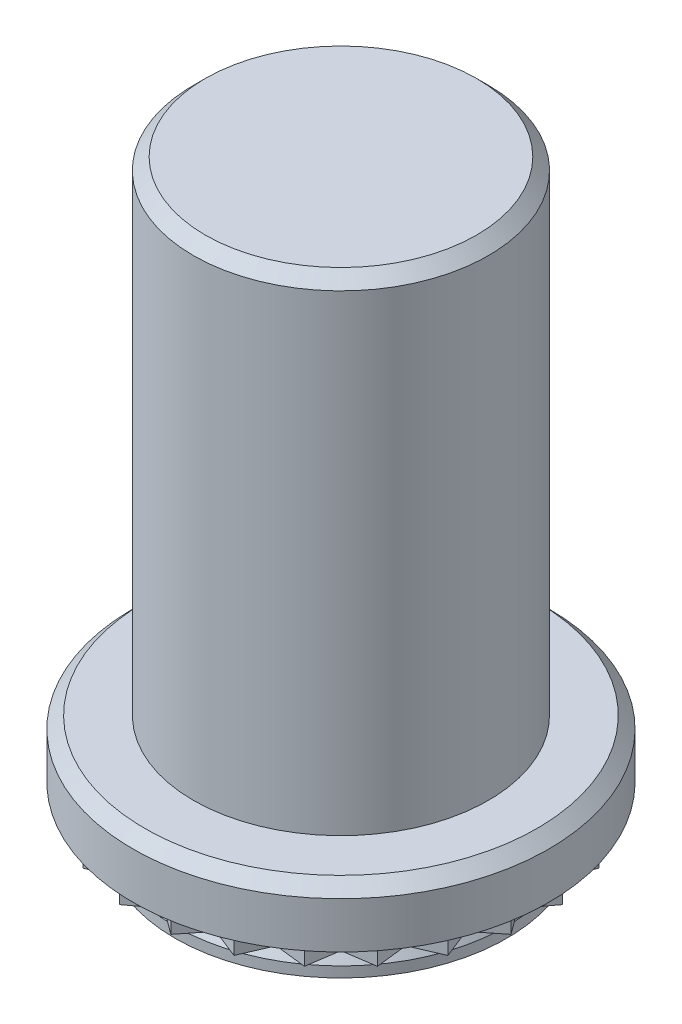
ISO-10303-21;
HEADER;
FILE_DESCRIPTION(('STEP AP214'),'2;1');
FILE_NAME('part.step','',(''),(''),'','','');
FILE_SCHEMA(('AUTOMOTIVE_DESIGN { 1 0 10303 214 1 1 1 1 }'));
ENDSEC;
DATA;
#1=APPLICATION_CONTEXT('core data for automotive mechanical design processes');
#2=APPLICATION_PROTOCOL_DEFINITION('international standard','automotive_design',2000,#1);
#3=PRODUCT_CONTEXT('',#1,'mechanical');
#4=PRODUCT('Part','Part','',(#3));
#5=PRODUCT_RELATED_PRODUCT_CATEGORY('part','',(#4));
#6=PRODUCT_DEFINITION_FORMATION('','',#4);
#7=PRODUCT_DEFINITION_CONTEXT('part definition',#1,'design');
#8=PRODUCT_DEFINITION('design','',#6,#7);
#9=PRODUCT_DEFINITION_SHAPE('','',#8);
#10=(LENGTH_UNIT() NAMED_UNIT(*) SI_UNIT(.MILLI.,.METRE.));
#11=(NAMED_UNIT(*) PLANE_ANGLE_UNIT() SI_UNIT($,.RADIAN.));
#12=(NAMED_UNIT(*) SI_UNIT($,.STERADIAN.) SOLID_ANGLE_UNIT());
#13=UNCERTAINTY_MEASURE_WITH_UNIT(LENGTH_MEASURE(1.E-05),#10,'distance_accuracy_value','');
#14=(GEOMETRIC_REPRESENTATION_CONTEXT(3) GLOBAL_UNCERTAINTY_ASSIGNED_CONTEXT((#13)) GLOBAL_UNIT_ASSIGNED_CONTEXT((#10,
#11,#12)) REPRESENTATION_CONTEXT('',''));
#15=CARTESIAN_POINT('',(0.,0.,0.));
#16=DIRECTION('',(0.,0.,1.));
#17=DIRECTION('',(1.,0.,0.));
#18=AXIS2_PLACEMENT_3D('',#15,#16,#17);
#19=CARTESIAN_POINT('',(5.18795,0.,0.));
#20=DIRECTION('',(0.,-1.,0.));
#21=DIRECTION('',(0.,0.,-1.));
#22=AXIS2_PLACEMENT_3D('',#19,#20,#21);
#23=PLANE('',#22);
#24=CARTESIAN_POINT('',(0.,0.,0.));
#25=DIRECTION('',(0.,-1.,0.));
#26=DIRECTION('',(0.,0.,-1.));
#27=AXIS2_PLACEMENT_3D('',#24,#25,#26);
#28=CIRCLE('',#27,5.461);
#29=CARTESIAN_POINT('',(0.,0.,-5.461));
#30=VERTEX_POINT('',#29);
#31=EDGE_CURVE('E765',#30,#30,#28,.T.);
#32=ORIENTED_EDGE('',*,*,#31,.T.);
#33=EDGE_LOOP('',(#32));
#34=FACE_BOUND('',#33,.T.);
#35=DIRECTION('',(0.398187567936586,0.,0.91730401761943));
#36=VECTOR('',#35,1.);
#37=CARTESIAN_POINT('',(-1.9853425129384,0.,4.79304082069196));
#38=LINE('',#37,#36);
#39=CARTESIAN_POINT('',(-2.32092499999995,0.,4.01996002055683));
#40=VERTEX_POINT('',#39);
#41=CARTESIAN_POINT('',(-1.9853425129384,0.,4.79304082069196));
#42=VERTEX_POINT('',#41);
#43=EDGE_CURVE('E364',#40,#42,#38,.T.);
#44=ORIENTED_EDGE('',*,*,#43,.T.);
#45=DIRECTION('',(0.930193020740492,0.,-0.367070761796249));
#46=VECTOR('',#45,1.);
#47=CARTESIAN_POINT('',(-1.20139918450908,0.,4.48368279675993));
#48=LINE('',#47,#46);
#49=CARTESIAN_POINT('',(-1.20139918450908,0.,4.48368279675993));
#50=VERTEX_POINT('',#49);
#51=EDGE_CURVE('E347',#42,#50,#48,.T.);
#52=ORIENTED_EDGE('',*,*,#51,.T.);
#53=DIRECTION('',(0.622035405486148,0.,0.782989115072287));
#54=VECTOR('',#53,1.);
#55=CARTESIAN_POINT('',(-0.677163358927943,0.,5.14356636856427));
#56=LINE('',#55,#54);
#57=CARTESIAN_POINT('',(-0.677163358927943,0.,5.14356636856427));
#58=VERTEX_POINT('',#57);
#59=EDGE_CURVE('E355',#50,#58,#56,.T.);
#60=ORIENTED_EDGE('',*,*,#59,.T.);
#61=DIRECTION('',(0.803492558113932,0.,-0.595314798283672));
#62=VECTOR('',#61,1.);
#63=CARTESIAN_POINT('',(0.,0.,4.64185));
#64=LINE('',#63,#62);
#65=CARTESIAN_POINT('',(0.,0.,4.64185));
#66=VERTEX_POINT('',#65);
#67=EDGE_CURVE('E721',#58,#66,#64,.T.);
#68=ORIENTED_EDGE('',*,*,#67,.T.);
#69=DIRECTION('',(0.803492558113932,0.,0.595314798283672));
#70=VECTOR('',#69,1.);
#71=CARTESIAN_POINT('',(0.677163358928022,0.,5.14356636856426));
#72=LINE('',#71,#70);
#73=CARTESIAN_POINT('',(0.677163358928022,0.,5.14356636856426));
#74=VERTEX_POINT('',#73);
#75=EDGE_CURVE('E723',#66,#74,#72,.T.);
#76=ORIENTED_EDGE('',*,*,#75,.T.);
#77=DIRECTION('',(0.622035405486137,0.,-0.782989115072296));
#78=VECTOR('',#77,1.);
#79=CARTESIAN_POINT('',(1.20139918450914,0.,4.48368279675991));
#80=LINE('',#79,#78);
#81=CARTESIAN_POINT('',(1.20139918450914,0.,4.48368279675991));
#82=VERTEX_POINT('',#81);
#83=EDGE_CURVE('E55',#74,#82,#80,.T.);
#84=ORIENTED_EDGE('',*,*,#83,.T.);
#85=DIRECTION('',(0.930193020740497,0.,0.367070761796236));
#86=VECTOR('',#85,1.);
#87=CARTESIAN_POINT('',(1.98534251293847,0.,4.79304082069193));
#88=LINE('',#87,#86);
#89=CARTESIAN_POINT('',(1.98534251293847,0.,4.79304082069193));
#90=VERTEX_POINT('',#89);
#91=EDGE_CURVE('E708',#82,#90,#88,.T.);
#92=ORIENTED_EDGE('',*,*,#91,.T.);
#93=DIRECTION('',(0.398187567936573,0.,-0.917304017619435));
#94=VECTOR('',#93,1.);
#95=CARTESIAN_POINT('',(2.320925,0.,4.01996002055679));
#96=LINE('',#95,#94);
#97=CARTESIAN_POINT('',(2.320925,0.,4.01996002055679));
#98=VERTEX_POINT('',#97);
#99=EDGE_CURVE('E694',#90,#98,#96,.T.);
#100=ORIENTED_EDGE('',*,*,#99,.T.);
#101=DIRECTION('',(0.993502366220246,0.,0.113811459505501));
#102=VECTOR('',#101,1.);
#103=CARTESIAN_POINT('',(3.1582238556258,0.,4.11587746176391));
#104=LINE('',#103,#102);
#105=CARTESIAN_POINT('',(3.1582238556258,0.,4.11587746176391));
#106=VERTEX_POINT('',#105);
#107=EDGE_CURVE('E689',#98,#106,#104,.T.);
#108=ORIENTED_EDGE('',*,*,#107,.T.);
#109=DIRECTION('',(0.1472039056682,0.,-0.989106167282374));
#110=VECTOR('',#109,1.);
#111=CARTESIAN_POINT('',(3.28228361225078,0.,3.28228361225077));
#112=LINE('',#111,#110);
#113=CARTESIAN_POINT('',(3.28228361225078,0.,3.28228361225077));
#114=VERTEX_POINT('',#113);
#115=EDGE_CURVE('E675',#106,#114,#112,.T.);
#116=ORIENTED_EDGE('',*,*,#115,.T.);
#117=DIRECTION('',(0.989106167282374,0.,-0.147203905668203));
#118=VECTOR('',#117,1.);
#119=CARTESIAN_POINT('',(4.11587746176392,0.,3.15822385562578));
#120=LINE('',#119,#118);
#121=CARTESIAN_POINT('',(4.11587746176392,0.,3.15822385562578));
#122=VERTEX_POINT('',#121);
#123=EDGE_CURVE('E678',#114,#122,#120,.T.);
#124=ORIENTED_EDGE('',*,*,#123,.T.);
#125=DIRECTION('',(-0.113811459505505,0.,-0.993502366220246));
#126=VECTOR('',#125,1.);
#127=CARTESIAN_POINT('',(4.0199600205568,0.,2.32092499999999));
#128=LINE('',#127,#126);
#129=CARTESIAN_POINT('',(4.0199600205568,0.,2.32092499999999));
#130=VERTEX_POINT('',#129);
#131=EDGE_CURVE('E659',#122,#130,#128,.T.);
#132=ORIENTED_EDGE('',*,*,#131,.T.);
#133=DIRECTION('',(0.917304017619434,0.,-0.398187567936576));
#134=VECTOR('',#133,1.);
#135=CARTESIAN_POINT('',(4.79304082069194,0.,1.98534251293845));
#136=LINE('',#135,#134);
#137=CARTESIAN_POINT('',(4.79304082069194,0.,1.98534251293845));
#138=VERTEX_POINT('',#137);
#139=EDGE_CURVE('E662',#130,#138,#136,.T.);
#140=ORIENTED_EDGE('',*,*,#139,.T.);
#141=DIRECTION('',(-0.367070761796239,0.,-0.930193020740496));
#142=VECTOR('',#141,1.);
#143=CARTESIAN_POINT('',(4.48368279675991,0.,1.20139918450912));
#144=LINE('',#143,#142);
#145=CARTESIAN_POINT('',(4.48368279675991,0.,1.20139918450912));
#146=VERTEX_POINT('',#145);
#147=EDGE_CURVE('E643',#138,#146,#144,.T.);
#148=ORIENTED_EDGE('',*,*,#147,.T.);
#149=DIRECTION('',(0.782989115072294,0.,-0.62203540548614));
#150=VECTOR('',#149,1.);
#151=CARTESIAN_POINT('',(5.14356636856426,0.,0.677163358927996));
#152=LINE('',#151,#150);
#153=CARTESIAN_POINT('',(5.14356636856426,0.,0.677163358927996));
#154=VERTEX_POINT('',#153);
#155=EDGE_CURVE('E646',#146,#154,#152,.T.);
#156=ORIENTED_EDGE('',*,*,#155,.T.);
#157=DIRECTION('',(-0.595314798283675,0.,-0.80349255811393));
#158=VECTOR('',#157,1.);
#159=CARTESIAN_POINT('',(4.64185,0.,0.));
#160=LINE('',#159,#158);
#161=CARTESIAN_POINT('',(4.64185,0.,0.));
#162=VERTEX_POINT('',#161);
#163=EDGE_CURVE('E627',#154,#162,#160,.T.);
#164=ORIENTED_EDGE('',*,*,#163,.T.);
#165=DIRECTION('',(0.595314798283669,0.,-0.803492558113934));
#166=VECTOR('',#165,1.);
#167=CARTESIAN_POINT('',(5.14356636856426,0.,-0.67716335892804));
#168=LINE('',#167,#166);
#169=CARTESIAN_POINT('',(5.14356636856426,0.,-0.67716335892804));
#170=VERTEX_POINT('',#169);
#171=EDGE_CURVE('E630',#162,#170,#168,.T.);
#172=ORIENTED_EDGE('',*,*,#171,.T.);
#173=DIRECTION('',(-0.782989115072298,0.,-0.622035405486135));
#174=VECTOR('',#173,1.);
#175=CARTESIAN_POINT('',(4.48368279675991,0.,-1.20139918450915));
#176=LINE('',#175,#174);
#177=CARTESIAN_POINT('',(4.48368279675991,0.,-1.20139918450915));
#178=VERTEX_POINT('',#177);
#179=EDGE_CURVE('E611',#170,#178,#176,.T.);
#180=ORIENTED_EDGE('',*,*,#179,.T.);
#181=DIRECTION('',(0.367070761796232,0.,-0.930193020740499));
#182=VECTOR('',#181,1.);
#183=CARTESIAN_POINT('',(4.79304082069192,0.,-1.98534251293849));
#184=LINE('',#183,#182);
#185=CARTESIAN_POINT('',(4.79304082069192,0.,-1.98534251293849));
#186=VERTEX_POINT('',#185);
#187=EDGE_CURVE('E614',#178,#186,#184,.T.);
#188=ORIENTED_EDGE('',*,*,#187,.T.);
#189=DIRECTION('',(-0.917304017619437,0.,-0.39818756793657));
#190=VECTOR('',#189,1.);
#191=CARTESIAN_POINT('',(4.01996002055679,0.,-2.32092500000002));
#192=LINE('',#191,#190);
#193=CARTESIAN_POINT('',(4.01996002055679,0.,-2.32092500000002));
#194=VERTEX_POINT('',#193);
#195=EDGE_CURVE('E595',#186,#194,#192,.T.);
#196=ORIENTED_EDGE('',*,*,#195,.T.);
#197=DIRECTION('',(0.113811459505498,0.,-0.993502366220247));
#198=VECTOR('',#197,1.);
#199=CARTESIAN_POINT('',(4.1158774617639,0.,-3.15822385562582));
#200=LINE('',#199,#198);
#201=CARTESIAN_POINT('',(4.1158774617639,0.,-3.15822385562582));
#202=VERTEX_POINT('',#201);
#203=EDGE_CURVE('E598',#194,#202,#200,.T.);
#204=ORIENTED_EDGE('',*,*,#203,.T.);
#205=DIRECTION('',(-0.989106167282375,0.,-0.147203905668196));
#206=VECTOR('',#205,1.);
#207=CARTESIAN_POINT('',(3.28228361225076,0.,-3.28228361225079));
#208=LINE('',#207,#206);
#209=CARTESIAN_POINT('',(3.28228361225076,0.,-3.28228361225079));
#210=VERTEX_POINT('',#209);
#211=EDGE_CURVE('E579',#202,#210,#208,.T.);
#212=ORIENTED_EDGE('',*,*,#211,.T.);
#213=DIRECTION('',(-0.147203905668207,0.,-0.989106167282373));
#214=VECTOR('',#213,1.);
#215=CARTESIAN_POINT('',(3.15822385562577,0.,-4.11587746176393));
#216=LINE('',#215,#214);
#217=CARTESIAN_POINT('',(3.15822385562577,0.,-4.11587746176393));
#218=VERTEX_POINT('',#217);
#219=EDGE_CURVE('E582',#210,#218,#216,.T.);
#220=ORIENTED_EDGE('',*,*,#219,.T.);
#221=DIRECTION('',(-0.993502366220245,0.,0.113811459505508));
#222=VECTOR('',#221,1.);
#223=CARTESIAN_POINT('',(2.32092499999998,0.,-4.01996002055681));
#224=LINE('',#223,#222);
#225=CARTESIAN_POINT('',(2.32092499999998,0.,-4.01996002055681));
#226=VERTEX_POINT('',#225);
#227=EDGE_CURVE('E563',#218,#226,#224,.T.);
#228=ORIENTED_EDGE('',*,*,#227,.T.);
#229=DIRECTION('',(-0.398187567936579,0.,-0.917304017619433));
#230=VECTOR('',#229,1.);
#231=CARTESIAN_POINT('',(1.98534251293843,0.,-4.79304082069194));
#232=LINE('',#231,#230);
#233=CARTESIAN_POINT('',(1.98534251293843,0.,-4.79304082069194));
#234=VERTEX_POINT('',#233);
#235=EDGE_CURVE('E566',#226,#234,#232,.T.);
#236=ORIENTED_EDGE('',*,*,#235,.T.);
#237=DIRECTION('',(-0.930193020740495,0.,0.367070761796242));
#238=VECTOR('',#237,1.);
#239=CARTESIAN_POINT('',(1.20139918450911,0.,-4.48368279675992));
#240=LINE('',#239,#238);
#241=CARTESIAN_POINT('',(1.20139918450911,0.,-4.48368279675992));
#242=VERTEX_POINT('',#241);
#243=EDGE_CURVE('E547',#234,#242,#240,.T.);
#244=ORIENTED_EDGE('',*,*,#243,.T.);
#245=DIRECTION('',(-0.622035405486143,0.,-0.782989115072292));
#246=VECTOR('',#245,1.);
#247=CARTESIAN_POINT('',(0.677163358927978,0.,-5.14356636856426));
#248=LINE('',#247,#246);
#249=CARTESIAN_POINT('',(0.677163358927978,0.,-5.14356636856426));
#250=VERTEX_POINT('',#249);
#251=EDGE_CURVE('E550',#242,#250,#248,.T.);
#252=ORIENTED_EDGE('',*,*,#251,.T.);
#253=DIRECTION('',(-0.803492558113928,0.,0.595314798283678));
#254=VECTOR('',#253,1.);
#255=CARTESIAN_POINT('',(0.,0.,-4.64185));
#256=LINE('',#255,#254);
#257=CARTESIAN_POINT('',(0.,0.,-4.64185));
#258=VERTEX_POINT('',#257);
#259=EDGE_CURVE('E531',#250,#258,#256,.T.);
#260=ORIENTED_EDGE('',*,*,#259,.T.);
#261=DIRECTION('',(-0.803492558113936,0.,-0.595314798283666));
#262=VECTOR('',#261,1.);
#263=CARTESIAN_POINT('',(-0.677163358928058,0.,-5.14356636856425));
#264=LINE('',#263,#262);
#265=CARTESIAN_POINT('',(-0.677163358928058,0.,-5.14356636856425));
#266=VERTEX_POINT('',#265);
#267=EDGE_CURVE('E534',#258,#266,#264,.T.);
#268=ORIENTED_EDGE('',*,*,#267,.T.);
#269=DIRECTION('',(-0.622035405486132,0.,0.7829891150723));
#270=VECTOR('',#269,1.);
#271=CARTESIAN_POINT('',(-1.20139918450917,0.,-4.4836827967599));
#272=LINE('',#271,#270);
#273=CARTESIAN_POINT('',(-1.20139918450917,0.,-4.4836827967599));
#274=VERTEX_POINT('',#273);
#275=EDGE_CURVE('E515',#266,#274,#272,.T.);
#276=ORIENTED_EDGE('',*,*,#275,.T.);
#277=DIRECTION('',(-0.9301930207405,0.,-0.367070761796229));
#278=VECTOR('',#277,1.);
#279=CARTESIAN_POINT('',(-1.98534251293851,0.,-4.79304082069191));
#280=LINE('',#279,#278);
#281=CARTESIAN_POINT('',(-1.98534251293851,0.,-4.79304082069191));
#282=VERTEX_POINT('',#281);
#283=EDGE_CURVE('E518',#274,#282,#280,.T.);
#284=ORIENTED_EDGE('',*,*,#283,.T.);
#285=DIRECTION('',(-0.398187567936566,0.,0.917304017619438));
#286=VECTOR('',#285,1.);
#287=CARTESIAN_POINT('',(-2.32092500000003,0.,-4.01996002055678));
#288=LINE('',#287,#286);
#289=CARTESIAN_POINT('',(-2.32092500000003,0.,-4.01996002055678));
#290=VERTEX_POINT('',#289);
#291=EDGE_CURVE('E499',#282,#290,#288,.T.);
#292=ORIENTED_EDGE('',*,*,#291,.T.);
#293=DIRECTION('',(-0.993502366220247,0.,-0.113811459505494));
#294=VECTOR('',#293,1.);
#295=CARTESIAN_POINT('',(-3.15822385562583,0.,-4.11587746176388));
#296=LINE('',#295,#294);
#297=CARTESIAN_POINT('',(-3.15822385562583,0.,-4.11587746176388));
#298=VERTEX_POINT('',#297);
#299=EDGE_CURVE('E502',#290,#298,#296,.T.);
#300=ORIENTED_EDGE('',*,*,#299,.T.);
#301=DIRECTION('',(-0.147203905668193,0.,0.989106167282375));
#302=VECTOR('',#301,1.);
#303=CARTESIAN_POINT('',(-3.2822836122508,0.,-3.28228361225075));
#304=LINE('',#303,#302);
#305=CARTESIAN_POINT('',(-3.2822836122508,0.,-3.28228361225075));
#306=VERTEX_POINT('',#305);
#307=EDGE_CURVE('E483',#298,#306,#304,.T.);
#308=ORIENTED_EDGE('',*,*,#307,.T.);
#309=DIRECTION('',(-0.989106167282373,0.,0.14720390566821));
#310=VECTOR('',#309,1.);
#311=CARTESIAN_POINT('',(-4.11587746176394,0.,-3.15822385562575));
#312=LINE('',#311,#310);
#313=CARTESIAN_POINT('',(-4.11587746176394,0.,-3.15822385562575));
#314=VERTEX_POINT('',#313);
#315=EDGE_CURVE('E486',#306,#314,#312,.T.);
#316=ORIENTED_EDGE('',*,*,#315,.T.);
#317=DIRECTION('',(0.113811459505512,0.,0.993502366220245));
#318=VECTOR('',#317,1.);
#319=CARTESIAN_POINT('',(-4.01996002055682,0.,-2.32092499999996));
#320=LINE('',#319,#318);
#321=CARTESIAN_POINT('',(-4.01996002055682,0.,-2.32092499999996));
#322=VERTEX_POINT('',#321);
#323=EDGE_CURVE('E467',#314,#322,#320,.T.);
#324=ORIENTED_EDGE('',*,*,#323,.T.);
#325=DIRECTION('',(-0.917304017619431,0.,0.398187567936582));
#326=VECTOR('',#325,1.);
#327=CARTESIAN_POINT('',(-4.79304082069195,0.,-1.98534251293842));
#328=LINE('',#327,#326);
#329=CARTESIAN_POINT('',(-4.79304082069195,0.,-1.98534251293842));
#330=VERTEX_POINT('',#329);
#331=EDGE_CURVE('E470',#322,#330,#328,.T.);
#332=ORIENTED_EDGE('',*,*,#331,.T.);
#333=DIRECTION('',(0.367070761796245,0.,0.930193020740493));
#334=VECTOR('',#333,1.);
#335=CARTESIAN_POINT('',(-4.48368279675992,0.,-1.20139918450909));
#336=LINE('',#335,#334);
#337=CARTESIAN_POINT('',(-4.48368279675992,0.,-1.20139918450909));
#338=VERTEX_POINT('',#337);
#339=EDGE_CURVE('E451',#330,#338,#336,.T.);
#340=ORIENTED_EDGE('',*,*,#339,.T.);
#341=DIRECTION('',(-0.782989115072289,0.,0.622035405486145));
#342=VECTOR('',#341,1.);
#343=CARTESIAN_POINT('',(-5.14356636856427,0.,-0.67716335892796));
#344=LINE('',#343,#342);
#345=CARTESIAN_POINT('',(-5.14356636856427,0.,-0.67716335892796));
#346=VERTEX_POINT('',#345);
#347=EDGE_CURVE('E454',#338,#346,#344,.T.);
#348=ORIENTED_EDGE('',*,*,#347,.T.);
#349=DIRECTION('',(0.59531479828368,0.,0.803492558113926));
#350=VECTOR('',#349,1.);
#351=CARTESIAN_POINT('',(-4.64185,0.,0.));
#352=LINE('',#351,#350);
#353=CARTESIAN_POINT('',(-4.64185,0.,0.));
#354=VERTEX_POINT('',#353);
#355=EDGE_CURVE('E435',#346,#354,#352,.T.);
#356=ORIENTED_EDGE('',*,*,#355,.T.);
#357=DIRECTION('',(-0.595314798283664,0.,0.803492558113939));
#358=VECTOR('',#357,1.);
#359=CARTESIAN_POINT('',(-5.14356636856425,0.,0.677163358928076));
#360=LINE('',#359,#358);
#361=CARTESIAN_POINT('',(-5.14356636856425,0.,0.677163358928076));
#362=VERTEX_POINT('',#361);
#363=EDGE_CURVE('E438',#354,#362,#360,.T.);
#364=ORIENTED_EDGE('',*,*,#363,.T.);
#365=DIRECTION('',(0.782989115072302,0.,0.622035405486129));
#366=VECTOR('',#365,1.);
#367=CARTESIAN_POINT('',(-4.4836827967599,0.,1.20139918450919));
#368=LINE('',#367,#366);
#369=CARTESIAN_POINT('',(-4.4836827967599,0.,1.20139918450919));
#370=VERTEX_POINT('',#369);
#371=EDGE_CURVE('E419',#362,#370,#368,.T.);
#372=ORIENTED_EDGE('',*,*,#371,.T.);
#373=DIRECTION('',(-0.367070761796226,0.,0.930193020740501));
#374=VECTOR('',#373,1.);
#375=CARTESIAN_POINT('',(-4.79304082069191,0.,1.98534251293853));
#376=LINE('',#375,#374);
#377=CARTESIAN_POINT('',(-4.79304082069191,0.,1.98534251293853));
#378=VERTEX_POINT('',#377);
#379=EDGE_CURVE('E422',#370,#378,#376,.T.);
#380=ORIENTED_EDGE('',*,*,#379,.T.);
#381=DIRECTION('',(0.91730401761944,0.,0.398187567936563));
#382=VECTOR('',#381,1.);
#383=CARTESIAN_POINT('',(-4.01996002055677,0.,2.32092500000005));
#384=LINE('',#383,#382);
#385=CARTESIAN_POINT('',(-4.01996002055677,0.,2.32092500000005));
#386=VERTEX_POINT('',#385);
#387=EDGE_CURVE('E403',#378,#386,#384,.T.);
#388=ORIENTED_EDGE('',*,*,#387,.T.);
#389=DIRECTION('',(-0.113811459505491,0.,0.993502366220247));
#390=VECTOR('',#389,1.);
#391=CARTESIAN_POINT('',(-4.11587746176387,0.,3.15822385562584));
#392=LINE('',#391,#390);
#393=CARTESIAN_POINT('',(-4.11587746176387,0.,3.15822385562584));
#394=VERTEX_POINT('',#393);
#395=EDGE_CURVE('E406',#386,#394,#392,.T.);
#396=ORIENTED_EDGE('',*,*,#395,.T.);
#397=DIRECTION('',(0.989106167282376,0.,0.14720390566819));
#398=VECTOR('',#397,1.);
#399=CARTESIAN_POINT('',(-3.28228361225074,0.,3.28228361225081));
#400=LINE('',#399,#398);
#401=CARTESIAN_POINT('',(-3.28228361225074,0.,3.28228361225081));
#402=VERTEX_POINT('',#401);
#403=EDGE_CURVE('E387',#394,#402,#400,.T.);
#404=ORIENTED_EDGE('',*,*,#403,.T.);
#405=DIRECTION('',(0.147203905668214,0.,0.989106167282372));
#406=VECTOR('',#405,1.);
#407=CARTESIAN_POINT('',(-3.15822385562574,0.,4.11587746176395));
#408=LINE('',#407,#406);
#409=CARTESIAN_POINT('',(-3.15822385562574,0.,4.11587746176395));
#410=VERTEX_POINT('',#409);
#411=EDGE_CURVE('E390',#402,#410,#408,.T.);
#412=ORIENTED_EDGE('',*,*,#411,.T.);
#413=DIRECTION('',(0.993502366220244,0.,-0.113811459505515));
#414=VECTOR('',#413,1.);
#415=CARTESIAN_POINT('',(-2.32092499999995,0.,4.01996002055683));
#416=LINE('',#415,#414);
#417=EDGE_CURVE('E374',#410,#40,#416,.T.);
#418=ORIENTED_EDGE('',*,*,#417,.T.);
#419=EDGE_LOOP('',(#44,#52,#60,#68,#76,#84,#92,#100,#108,#116,#124,#132,#140,#148,#156,#164,
#172,#180,#188,#196,#204,#212,#220,#228,#236,#244,#252,#260,#268,#276,#284,#292,#300,#308,#316,
#324,#332,#340,#348,#356,#364,#372,#380,#388,#396,#404,#412,#418));
#420=FACE_BOUND('',#419,.T.);
#421=ADVANCED_FACE('F39',(#34,#420),#23,.T.);
#422=CARTESIAN_POINT('',(0.,0.,0.));
#423=DIRECTION('',(0.,-1.,0.));
#424=DIRECTION('',(0.,0.,-1.));
#425=AXIS2_PLACEMENT_3D('',#422,#423,#424);
#426=CYLINDRICAL_SURFACE('',#425,5.461);
#427=CARTESIAN_POINT('',(0.,1.21285,0.));
#428=DIRECTION('',(0.,1.,0.));
#429=DIRECTION('',(0.,0.,1.));
#430=AXIS2_PLACEMENT_3D('',#427,#428,#429);
#431=CIRCLE('',#430,5.461);
#432=CARTESIAN_POINT('',(0.,1.21285,-5.461));
#433=VERTEX_POINT('',#432);
#434=EDGE_CURVE('E768',#433,#433,#431,.F.);
#435=ORIENTED_EDGE('',*,*,#434,.T.);
#436=EDGE_LOOP('',(#435));
#437=FACE_BOUND('',#436,.T.);
#438=ORIENTED_EDGE('',*,*,#31,.F.);
#439=EDGE_LOOP('',(#438));
#440=FACE_BOUND('',#439,.T.);
#441=ADVANCED_FACE('F797',(#437,#440),#426,.T.);
#442=CARTESIAN_POINT('',(5.461,1.524,0.));
#443=DIRECTION('',(0.,1.,0.));
#444=DIRECTION('',(0.,0.,1.));
#445=AXIS2_PLACEMENT_3D('',#442,#443,#444);
#446=PLANE('',#445);
#447=CARTESIAN_POINT('',(0.,1.524,0.));
#448=DIRECTION('',(0.,1.,0.));
#449=DIRECTION('',(0.,0.,1.));
#450=AXIS2_PLACEMENT_3D('',#447,#448,#449);
#451=CIRCLE('',#450,5.14985);
#452=CARTESIAN_POINT('',(0.,1.524,-5.14985));
#453=VERTEX_POINT('',#452);
#454=EDGE_CURVE('E771',#453,#453,#451,.T.);
#455=ORIENTED_EDGE('',*,*,#454,.T.);
#456=EDGE_LOOP('',(#455));
#457=FACE_BOUND('',#456,.T.);
#458=CARTESIAN_POINT('',(0.,1.524,0.));
#459=DIRECTION('',(0.,-1.,0.));
#460=DIRECTION('',(0.,0.,-1.));
#461=AXIS2_PLACEMENT_3D('',#458,#459,#460);
#462=CIRCLE('',#461,3.8735);
#463=CARTESIAN_POINT('',(0.,1.524,-3.8735));
#464=VERTEX_POINT('',#463);
#465=EDGE_CURVE('E762',#464,#464,#462,.T.);
#466=ORIENTED_EDGE('',*,*,#465,.T.);
#467=EDGE_LOOP('',(#466));
#468=FACE_BOUND('',#467,.T.);
#469=ADVANCED_FACE('F805',(#457,#468),#446,.T.);
#470=CARTESIAN_POINT('',(0.,0.,0.));
#471=DIRECTION('',(0.,-1.,0.));
#472=DIRECTION('',(0.,0.,-1.));
#473=AXIS2_PLACEMENT_3D('',#470,#471,#472);
#474=CYLINDRICAL_SURFACE('',#473,3.8735);
#475=CARTESIAN_POINT('',(0.,13.91285,0.));
#476=DIRECTION('',(0.,1.,0.));
#477=DIRECTION('',(0.,0.,1.));
#478=AXIS2_PLACEMENT_3D('',#475,#476,#477);
#479=CIRCLE('',#478,3.8735);
#480=CARTESIAN_POINT('',(0.,13.91285,3.8735));
#481=VERTEX_POINT('',#480);
#482=EDGE_CURVE('E48',#481,#481,#479,.F.);
#483=ORIENTED_EDGE('',*,*,#482,.T.);
#484=EDGE_LOOP('',(#483));
#485=FACE_BOUND('',#484,.T.);
#486=ORIENTED_EDGE('',*,*,#465,.F.);
#487=EDGE_LOOP('',(#486));
#488=FACE_BOUND('',#487,.T.);
#489=ADVANCED_FACE('F777',(#485,#488),#474,.T.);
#490=CARTESIAN_POINT('',(3.8735,14.224,0.));
#491=DIRECTION('',(0.,1.,0.));
#492=DIRECTION('',(0.,0.,1.));
#493=AXIS2_PLACEMENT_3D('',#490,#491,#492);
#494=PLANE('',#493);
#495=CARTESIAN_POINT('',(0.,14.224,0.));
#496=DIRECTION('',(0.,1.,0.));
#497=DIRECTION('',(0.,0.,1.));
#498=AXIS2_PLACEMENT_3D('',#495,#496,#497);
#499=CIRCLE('',#498,3.56235);
#500=CARTESIAN_POINT('',(0.,14.224,3.56235));
#501=VERTEX_POINT('',#500);
#502=EDGE_CURVE('E11',#501,#501,#499,.T.);
#503=ORIENTED_EDGE('',*,*,#502,.T.);
#504=EDGE_LOOP('',(#503));
#505=FACE_BOUND('',#504,.T.);
#506=ADVANCED_FACE('F814',(#505),#494,.T.);
#507=CARTESIAN_POINT('',(2.5527,-1.3716,0.));
#508=DIRECTION('',(0.,-1.,0.));
#509=DIRECTION('',(0.,0.,-1.));
#510=AXIS2_PLACEMENT_3D('',#507,#508,#509);
#511=PLANE('',#510);
#512=CARTESIAN_POINT('',(0.,-1.3716,0.));
#513=DIRECTION('',(0.,-1.,0.));
#514=DIRECTION('',(0.,0.,-1.));
#515=AXIS2_PLACEMENT_3D('',#512,#513,#514);
#516=CIRCLE('',#515,3.175);
#517=CARTESIAN_POINT('',(0.,-1.3716,-3.175));
#518=VERTEX_POINT('',#517);
#519=EDGE_CURVE('E43',#518,#518,#516,.T.);
#520=ORIENTED_EDGE('',*,*,#519,.F.);
#521=EDGE_LOOP('',(#520));
#522=FACE_BOUND('',#521,.T.);
#523=CARTESIAN_POINT('',(0.,-1.3716,0.));
#524=DIRECTION('',(0.,-1.,0.));
#525=DIRECTION('',(0.,0.,-1.));
#526=AXIS2_PLACEMENT_3D('',#523,#524,#525);
#527=CIRCLE('',#526,4.3561);
#528=CARTESIAN_POINT('',(0.,-1.3716,-4.3561));
#529=VERTEX_POINT('',#528);
#530=EDGE_CURVE('E756',#529,#529,#527,.T.);
#531=ORIENTED_EDGE('',*,*,#530,.T.);
#532=EDGE_LOOP('',(#531));
#533=FACE_BOUND('',#532,.T.);
#534=ADVANCED_FACE('F816',(#522,#533),#511,.T.);
#535=CARTESIAN_POINT('',(0.,0.,0.));
#536=DIRECTION('',(0.,-1.,0.));
#537=DIRECTION('',(0.,0.,-1.));
#538=AXIS2_PLACEMENT_3D('',#535,#536,#537);
#539=CYLINDRICAL_SURFACE('',#538,4.3561);
#540=CARTESIAN_POINT('',(0.,-1.09728,0.));
#541=DIRECTION('',(0.,-1.,0.));
#542=DIRECTION('',(0.,0.,-1.));
#543=AXIS2_PLACEMENT_3D('',#540,#541,#542);
#544=CIRCLE('',#543,4.3561);
#545=CARTESIAN_POINT('',(0.,-1.09728,-4.3561));
#546=VERTEX_POINT('',#545);
#547=EDGE_CURVE('E753',#546,#546,#544,.T.);
#548=ORIENTED_EDGE('',*,*,#547,.T.);
#549=EDGE_LOOP('',(#548));
#550=FACE_BOUND('',#549,.T.);
#551=ORIENTED_EDGE('',*,*,#530,.F.);
#552=EDGE_LOOP('',(#551));
#553=FACE_BOUND('',#552,.T.);
#554=ADVANCED_FACE('F827',(#550,#553),#539,.T.);
#555=CARTESIAN_POINT('',(0.,-1.09728,0.));
#556=DIRECTION('',(0.,-1.,0.));
#557=DIRECTION('',(0.,0.,-1.));
#558=AXIS2_PLACEMENT_3D('',#555,#556,#557);
#559=CONICAL_SURFACE('',#558,4.3561,0.523598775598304);
#560=CARTESIAN_POINT('',(0.,-0.54864,0.));
#561=DIRECTION('',(0.,-1.,0.));
#562=DIRECTION('',(0.,0.,-1.));
#563=AXIS2_PLACEMENT_3D('',#560,#561,#562);
#564=CIRCLE('',#563,4.0393425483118);
#565=CARTESIAN_POINT('',(0.,-0.54864,-4.0393425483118));
#566=VERTEX_POINT('',#565);
#567=EDGE_CURVE('E750',#566,#566,#564,.T.);
#568=ORIENTED_EDGE('',*,*,#567,.T.);
#569=EDGE_LOOP('',(#568));
#570=FACE_BOUND('',#569,.T.);
#571=ORIENTED_EDGE('',*,*,#547,.F.);
#572=EDGE_LOOP('',(#571));
#573=FACE_BOUND('',#572,.T.);
#574=ADVANCED_FACE('F831',(#570,#573),#559,.T.);
#575=CARTESIAN_POINT('',(0.,0.,0.));
#576=DIRECTION('',(0.,-1.,0.));
#577=DIRECTION('',(0.,0.,-1.));
#578=AXIS2_PLACEMENT_3D('',#575,#576,#577);
#579=CYLINDRICAL_SURFACE('',#578,4.0393425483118);
#580=CARTESIAN_POINT('',(0.,0.,0.));
#581=DIRECTION('',(0.,-1.,0.));
#582=DIRECTION('',(0.,0.,-1.));
#583=AXIS2_PLACEMENT_3D('',#580,#581,#582);
#584=CIRCLE('',#583,4.0393425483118);
#585=CARTESIAN_POINT('',(0.,0.,-4.0393425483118));
#586=VERTEX_POINT('',#585);
#587=EDGE_CURVE('E747',#586,#586,#584,.T.);
#588=ORIENTED_EDGE('',*,*,#587,.T.);
#589=EDGE_LOOP('',(#588));
#590=FACE_BOUND('',#589,.T.);
#591=ORIENTED_EDGE('',*,*,#567,.F.);
#592=EDGE_LOOP('',(#591));
#593=FACE_BOUND('',#592,.T.);
#594=ADVANCED_FACE('F835',(#590,#593),#579,.T.);
#595=CARTESIAN_POINT('',(4.0393425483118,0.,0.));
#596=DIRECTION('',(0.,-1.,0.));
#597=DIRECTION('',(0.,0.,-1.));
#598=AXIS2_PLACEMENT_3D('',#595,#596,#597);
#599=PLANE('',#598);
#600=CARTESIAN_POINT('',(0.,1.11022302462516E-13,0.));
#601=DIRECTION('',(0.,-1.,0.));
#602=DIRECTION('',(0.,0.,-1.));
#603=AXIS2_PLACEMENT_3D('',#600,#601,#602);
#604=CIRCLE('',#603,4.35610000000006);
#605=CARTESIAN_POINT('',(0.,1.11022302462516E-13,-4.35610000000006));
#606=VERTEX_POINT('',#605);
#607=EDGE_CURVE('E744',#606,#606,#604,.T.);
#608=ORIENTED_EDGE('',*,*,#607,.T.);
#609=EDGE_LOOP('',(#608));
#610=FACE_BOUND('',#609,.T.);
#611=ORIENTED_EDGE('',*,*,#587,.F.);
#612=EDGE_LOOP('',(#611));
#613=FACE_BOUND('',#612,.T.);
#614=ADVANCED_FACE('F839',(#610,#613),#599,.T.);
#615=CARTESIAN_POINT('',(0.,0.,0.));
#616=DIRECTION('',(0.,-1.,0.));
#617=DIRECTION('',(0.,0.,-1.));
#618=AXIS2_PLACEMENT_3D('',#615,#616,#617);
#619=CYLINDRICAL_SURFACE('',#618,4.35610000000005);
#620=CARTESIAN_POINT('',(0.,-0.548639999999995,0.));
#621=DIRECTION('',(0.,-1.,0.));
#622=DIRECTION('',(0.,0.,-1.));
#623=AXIS2_PLACEMENT_3D('',#620,#621,#622);
#624=CIRCLE('',#623,4.35610000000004);
#625=CARTESIAN_POINT('',(0.,-0.548639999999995,-4.35610000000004));
#626=VERTEX_POINT('',#625);
#627=EDGE_CURVE('E741',#626,#626,#624,.T.);
#628=ORIENTED_EDGE('',*,*,#627,.T.);
#629=EDGE_LOOP('',(#628));
#630=FACE_BOUND('',#629,.T.);
#631=ORIENTED_EDGE('',*,*,#607,.F.);
#632=EDGE_LOOP('',(#631));
#633=FACE_BOUND('',#632,.T.);
#634=ADVANCED_FACE('F843',(#630,#633),#619,.F.);
#635=CARTESIAN_POINT('',(4.35610000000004,-0.548639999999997,0.));
#636=DIRECTION('',(0.,-1.,0.));
#637=DIRECTION('',(0.,0.,-1.));
#638=AXIS2_PLACEMENT_3D('',#635,#636,#637);
#639=PLANE('',#638);
#640=DIRECTION('',(0.622035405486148,0.,0.782989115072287));
#641=VECTOR('',#640,1.);
#642=CARTESIAN_POINT('',(-0.677163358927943,-0.548639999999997,5.14356636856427));
#643=LINE('',#642,#641);
#644=CARTESIAN_POINT('',(-1.20139918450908,-0.548639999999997,4.48368279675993));
#645=VERTEX_POINT('',#644);
#646=CARTESIAN_POINT('',(-0.677163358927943,-0.548639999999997,5.14356636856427));
#647=VERTEX_POINT('',#646);
#648=EDGE_CURVE('E365',#645,#647,#643,.T.);
#649=ORIENTED_EDGE('',*,*,#648,.F.);
#650=DIRECTION('',(0.930193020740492,0.,-0.367070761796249));
#651=VECTOR('',#650,1.);
#652=CARTESIAN_POINT('',(-1.20139918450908,-0.548639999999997,4.48368279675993));
#653=LINE('',#652,#651);
#654=CARTESIAN_POINT('',(-1.98534251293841,-0.548639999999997,4.79304082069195));
#655=VERTEX_POINT('',#654);
#656=EDGE_CURVE('E350',#655,#645,#653,.T.);
#657=ORIENTED_EDGE('',*,*,#656,.F.);
#658=DIRECTION('',(0.398187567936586,0.,0.91730401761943));
#659=VECTOR('',#658,1.);
#660=CARTESIAN_POINT('',(-1.9853425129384,-0.548639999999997,4.79304082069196));
#661=LINE('',#660,#659);
#662=CARTESIAN_POINT('',(-2.32092499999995,-0.548639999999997,4.01996002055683));
#663=VERTEX_POINT('',#662);
#664=EDGE_CURVE('E376',#663,#655,#661,.T.);
#665=ORIENTED_EDGE('',*,*,#664,.F.);
#666=DIRECTION('',(0.993502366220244,0.,-0.113811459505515));
#667=VECTOR('',#666,1.);
#668=CARTESIAN_POINT('',(-2.32092499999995,-0.548639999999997,4.01996002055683));
#669=LINE('',#668,#667);
#670=CARTESIAN_POINT('',(-3.15822385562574,-0.548639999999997,4.11587746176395));
#671=VERTEX_POINT('',#670);
#672=EDGE_CURVE('E354',#671,#663,#669,.T.);
#673=ORIENTED_EDGE('',*,*,#672,.F.);
#674=DIRECTION('',(0.147203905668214,0.,0.989106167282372));
#675=VECTOR('',#674,1.);
#676=CARTESIAN_POINT('',(-3.15822385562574,-0.548639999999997,4.11587746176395));
#677=LINE('',#676,#675);
#678=CARTESIAN_POINT('',(-3.28228361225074,-0.548639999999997,3.28228361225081));
#679=VERTEX_POINT('',#678);
#680=EDGE_CURVE('E391',#679,#671,#677,.T.);
#681=ORIENTED_EDGE('',*,*,#680,.F.);
#682=DIRECTION('',(0.989106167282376,0.,0.14720390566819));
#683=VECTOR('',#682,1.);
#684=CARTESIAN_POINT('',(-3.28228361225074,-0.548639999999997,3.28228361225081));
#685=LINE('',#684,#683);
#686=CARTESIAN_POINT('',(-4.11587746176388,-0.548639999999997,3.15822385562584));
#687=VERTEX_POINT('',#686);
#688=EDGE_CURVE('E385',#687,#679,#685,.T.);
#689=ORIENTED_EDGE('',*,*,#688,.F.);
#690=DIRECTION('',(-0.113811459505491,0.,0.993502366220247));
#691=VECTOR('',#690,1.);
#692=CARTESIAN_POINT('',(-4.11587746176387,-0.548639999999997,3.15822385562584));
#693=LINE('',#692,#691);
#694=CARTESIAN_POINT('',(-4.01996002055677,-0.548639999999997,2.32092500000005));
#695=VERTEX_POINT('',#694);
#696=EDGE_CURVE('E407',#695,#687,#693,.T.);
#697=ORIENTED_EDGE('',*,*,#696,.F.);
#698=DIRECTION('',(0.91730401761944,0.,0.398187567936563));
#699=VECTOR('',#698,1.);
#700=CARTESIAN_POINT('',(-4.01996002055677,-0.548639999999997,2.32092500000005));
#701=LINE('',#700,#699);
#702=CARTESIAN_POINT('',(-4.79304082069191,-0.548639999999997,1.98534251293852));
#703=VERTEX_POINT('',#702);
#704=EDGE_CURVE('E401',#703,#695,#701,.T.);
#705=ORIENTED_EDGE('',*,*,#704,.F.);
#706=DIRECTION('',(-0.367070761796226,0.,0.930193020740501));
#707=VECTOR('',#706,1.);
#708=CARTESIAN_POINT('',(-4.79304082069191,-0.548639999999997,1.98534251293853));
#709=LINE('',#708,#707);
#710=CARTESIAN_POINT('',(-4.4836827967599,-0.548639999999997,1.20139918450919));
#711=VERTEX_POINT('',#710);
#712=EDGE_CURVE('E423',#711,#703,#709,.T.);
#713=ORIENTED_EDGE('',*,*,#712,.F.);
#714=DIRECTION('',(0.782989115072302,0.,0.622035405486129));
#715=VECTOR('',#714,1.);
#716=CARTESIAN_POINT('',(-4.4836827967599,-0.548639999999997,1.20139918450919));
#717=LINE('',#716,#715);
#718=CARTESIAN_POINT('',(-5.14356636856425,-0.548639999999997,0.677163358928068));
#719=VERTEX_POINT('',#718);
#720=EDGE_CURVE('E417',#719,#711,#717,.T.);
#721=ORIENTED_EDGE('',*,*,#720,.F.);
#722=DIRECTION('',(-0.595314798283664,0.,0.803492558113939));
#723=VECTOR('',#722,1.);
#724=CARTESIAN_POINT('',(-5.14356636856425,-0.548639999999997,0.677163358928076));
#725=LINE('',#724,#723);
#726=CARTESIAN_POINT('',(-4.64185,-0.548639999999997,0.));
#727=VERTEX_POINT('',#726);
#728=EDGE_CURVE('E439',#727,#719,#725,.T.);
#729=ORIENTED_EDGE('',*,*,#728,.F.);
#730=DIRECTION('',(0.59531479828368,0.,0.803492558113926));
#731=VECTOR('',#730,1.);
#732=CARTESIAN_POINT('',(-4.64185,-0.548639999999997,0.));
#733=LINE('',#732,#731);
#734=CARTESIAN_POINT('',(-5.14356636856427,-0.548639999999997,-0.677163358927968));
#735=VERTEX_POINT('',#734);
#736=EDGE_CURVE('E433',#735,#727,#733,.T.);
#737=ORIENTED_EDGE('',*,*,#736,.F.);
#738=DIRECTION('',(-0.782989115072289,0.,0.622035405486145));
#739=VECTOR('',#738,1.);
#740=CARTESIAN_POINT('',(-5.14356636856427,-0.548639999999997,-0.67716335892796));
#741=LINE('',#740,#739);
#742=CARTESIAN_POINT('',(-4.48368279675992,-0.548639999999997,-1.20139918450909));
#743=VERTEX_POINT('',#742);
#744=EDGE_CURVE('E455',#743,#735,#741,.T.);
#745=ORIENTED_EDGE('',*,*,#744,.F.);
#746=DIRECTION('',(0.367070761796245,0.,0.930193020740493));
#747=VECTOR('',#746,1.);
#748=CARTESIAN_POINT('',(-4.48368279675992,-0.548639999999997,-1.20139918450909));
#749=LINE('',#748,#747);
#750=CARTESIAN_POINT('',(-4.79304082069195,-0.548639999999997,-1.98534251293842));
#751=VERTEX_POINT('',#750);
#752=EDGE_CURVE('E449',#751,#743,#749,.T.);
#753=ORIENTED_EDGE('',*,*,#752,.F.);
#754=DIRECTION('',(-0.917304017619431,0.,0.398187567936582));
#755=VECTOR('',#754,1.);
#756=CARTESIAN_POINT('',(-4.79304082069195,-0.548639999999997,-1.98534251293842));
#757=LINE('',#756,#755);
#758=CARTESIAN_POINT('',(-4.01996002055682,-0.548639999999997,-2.32092499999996));
#759=VERTEX_POINT('',#758);
#760=EDGE_CURVE('E471',#759,#751,#757,.T.);
#761=ORIENTED_EDGE('',*,*,#760,.F.);
#762=DIRECTION('',(0.113811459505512,0.,0.993502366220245));
#763=VECTOR('',#762,1.);
#764=CARTESIAN_POINT('',(-4.01996002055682,-0.548639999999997,-2.32092499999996));
#765=LINE('',#764,#763);
#766=CARTESIAN_POINT('',(-4.11587746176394,-0.548639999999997,-3.15822385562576));
#767=VERTEX_POINT('',#766);
#768=EDGE_CURVE('E465',#767,#759,#765,.T.);
#769=ORIENTED_EDGE('',*,*,#768,.F.);
#770=DIRECTION('',(-0.989106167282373,0.,0.14720390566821));
#771=VECTOR('',#770,1.);
#772=CARTESIAN_POINT('',(-4.11587746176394,-0.548639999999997,-3.15822385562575));
#773=LINE('',#772,#771);
#774=CARTESIAN_POINT('',(-3.2822836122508,-0.548639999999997,-3.28228361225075));
#775=VERTEX_POINT('',#774);
#776=EDGE_CURVE('E487',#775,#767,#773,.T.);
#777=ORIENTED_EDGE('',*,*,#776,.F.);
#778=DIRECTION('',(-0.147203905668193,0.,0.989106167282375));
#779=VECTOR('',#778,1.);
#780=CARTESIAN_POINT('',(-3.2822836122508,-0.548639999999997,-3.28228361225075));
#781=LINE('',#780,#779);
#782=CARTESIAN_POINT('',(-3.15822385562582,-0.548639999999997,-4.11587746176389));
#783=VERTEX_POINT('',#782);
#784=EDGE_CURVE('E481',#783,#775,#781,.T.);
#785=ORIENTED_EDGE('',*,*,#784,.F.);
#786=DIRECTION('',(-0.993502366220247,0.,-0.113811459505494));
#787=VECTOR('',#786,1.);
#788=CARTESIAN_POINT('',(-3.15822385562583,-0.548639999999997,-4.11587746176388));
#789=LINE('',#788,#787);
#790=CARTESIAN_POINT('',(-2.32092500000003,-0.548639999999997,-4.01996002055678));
#791=VERTEX_POINT('',#790);
#792=EDGE_CURVE('E503',#791,#783,#789,.T.);
#793=ORIENTED_EDGE('',*,*,#792,.F.);
#794=DIRECTION('',(-0.398187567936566,0.,0.917304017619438));
#795=VECTOR('',#794,1.);
#796=CARTESIAN_POINT('',(-2.32092500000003,-0.548639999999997,-4.01996002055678));
#797=LINE('',#796,#795);
#798=CARTESIAN_POINT('',(-1.9853425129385,-0.548639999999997,-4.79304082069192));
#799=VERTEX_POINT('',#798);
#800=EDGE_CURVE('E497',#799,#791,#797,.T.);
#801=ORIENTED_EDGE('',*,*,#800,.F.);
#802=DIRECTION('',(-0.9301930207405,0.,-0.367070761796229));
#803=VECTOR('',#802,1.);
#804=CARTESIAN_POINT('',(-1.98534251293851,-0.548639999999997,-4.79304082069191));
#805=LINE('',#804,#803);
#806=CARTESIAN_POINT('',(-1.20139918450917,-0.548639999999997,-4.4836827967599));
#807=VERTEX_POINT('',#806);
#808=EDGE_CURVE('E519',#807,#799,#805,.T.);
#809=ORIENTED_EDGE('',*,*,#808,.F.);
#810=DIRECTION('',(-0.622035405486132,0.,0.7829891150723));
#811=VECTOR('',#810,1.);
#812=CARTESIAN_POINT('',(-1.20139918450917,-0.548639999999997,-4.4836827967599));
#813=LINE('',#812,#811);
#814=CARTESIAN_POINT('',(-0.67716335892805,-0.548639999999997,-5.14356636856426));
#815=VERTEX_POINT('',#814);
#816=EDGE_CURVE('E513',#815,#807,#813,.T.);
#817=ORIENTED_EDGE('',*,*,#816,.F.);
#818=DIRECTION('',(-0.803492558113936,0.,-0.595314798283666));
#819=VECTOR('',#818,1.);
#820=CARTESIAN_POINT('',(-0.677163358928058,-0.548639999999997,-5.14356636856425));
#821=LINE('',#820,#819);
#822=CARTESIAN_POINT('',(0.,-0.548639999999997,-4.64185));
#823=VERTEX_POINT('',#822);
#824=EDGE_CURVE('E535',#823,#815,#821,.T.);
#825=ORIENTED_EDGE('',*,*,#824,.F.);
#826=DIRECTION('',(-0.803492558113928,0.,0.595314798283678));
#827=VECTOR('',#826,1.);
#828=CARTESIAN_POINT('',(0.,-0.548639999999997,-4.64185));
#829=LINE('',#828,#827);
#830=CARTESIAN_POINT('',(0.677163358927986,-0.548639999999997,-5.14356636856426));
#831=VERTEX_POINT('',#830);
#832=EDGE_CURVE('E529',#831,#823,#829,.T.);
#833=ORIENTED_EDGE('',*,*,#832,.F.);
#834=DIRECTION('',(-0.622035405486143,0.,-0.782989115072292));
#835=VECTOR('',#834,1.);
#836=CARTESIAN_POINT('',(0.677163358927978,-0.548639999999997,-5.14356636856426));
#837=LINE('',#836,#835);
#838=CARTESIAN_POINT('',(1.20139918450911,-0.548639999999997,-4.48368279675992));
#839=VERTEX_POINT('',#838);
#840=EDGE_CURVE('E551',#839,#831,#837,.T.);
#841=ORIENTED_EDGE('',*,*,#840,.F.);
#842=DIRECTION('',(-0.930193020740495,0.,0.367070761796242));
#843=VECTOR('',#842,1.);
#844=CARTESIAN_POINT('',(1.20139918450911,-0.548639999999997,-4.48368279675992));
#845=LINE('',#844,#843);
#846=CARTESIAN_POINT('',(1.98534251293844,-0.548639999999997,-4.79304082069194));
#847=VERTEX_POINT('',#846);
#848=EDGE_CURVE('E545',#847,#839,#845,.T.);
#849=ORIENTED_EDGE('',*,*,#848,.F.);
#850=DIRECTION('',(-0.398187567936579,0.,-0.917304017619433));
#851=VECTOR('',#850,1.);
#852=CARTESIAN_POINT('',(1.98534251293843,-0.548639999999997,-4.79304082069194));
#853=LINE('',#852,#851);
#854=CARTESIAN_POINT('',(2.32092499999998,-0.548639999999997,-4.01996002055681));
#855=VERTEX_POINT('',#854);
#856=EDGE_CURVE('E567',#855,#847,#853,.T.);
#857=ORIENTED_EDGE('',*,*,#856,.F.);
#858=DIRECTION('',(-0.993502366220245,0.,0.113811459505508));
#859=VECTOR('',#858,1.);
#860=CARTESIAN_POINT('',(2.32092499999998,-0.548639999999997,-4.01996002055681));
#861=LINE('',#860,#859);
#862=CARTESIAN_POINT('',(3.15822385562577,-0.548639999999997,-4.11587746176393));
#863=VERTEX_POINT('',#862);
#864=EDGE_CURVE('E561',#863,#855,#861,.T.);
#865=ORIENTED_EDGE('',*,*,#864,.F.);
#866=DIRECTION('',(-0.147203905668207,0.,-0.989106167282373));
#867=VECTOR('',#866,1.);
#868=CARTESIAN_POINT('',(3.15822385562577,-0.548639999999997,-4.11587746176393));
#869=LINE('',#868,#867);
#870=CARTESIAN_POINT('',(3.28228361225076,-0.548639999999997,-3.28228361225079));
#871=VERTEX_POINT('',#870);
#872=EDGE_CURVE('E583',#871,#863,#869,.T.);
#873=ORIENTED_EDGE('',*,*,#872,.F.);
#874=DIRECTION('',(-0.989106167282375,0.,-0.147203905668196));
#875=VECTOR('',#874,1.);
#876=CARTESIAN_POINT('',(3.28228361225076,-0.548639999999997,-3.28228361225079));
#877=LINE('',#876,#875);
#878=CARTESIAN_POINT('',(4.1158774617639,-0.548639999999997,-3.15822385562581));
#879=VERTEX_POINT('',#878);
#880=EDGE_CURVE('E577',#879,#871,#877,.T.);
#881=ORIENTED_EDGE('',*,*,#880,.F.);
#882=DIRECTION('',(0.113811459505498,0.,-0.993502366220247));
#883=VECTOR('',#882,1.);
#884=CARTESIAN_POINT('',(4.1158774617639,-0.548639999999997,-3.15822385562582));
#885=LINE('',#884,#883);
#886=CARTESIAN_POINT('',(4.01996002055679,-0.548639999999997,-2.32092500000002));
#887=VERTEX_POINT('',#886);
#888=EDGE_CURVE('E599',#887,#879,#885,.T.);
#889=ORIENTED_EDGE('',*,*,#888,.F.);
#890=DIRECTION('',(-0.917304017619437,0.,-0.39818756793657));
#891=VECTOR('',#890,1.);
#892=CARTESIAN_POINT('',(4.01996002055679,-0.548639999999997,-2.32092500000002));
#893=LINE('',#892,#891);
#894=CARTESIAN_POINT('',(4.79304082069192,-0.548639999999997,-1.98534251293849));
#895=VERTEX_POINT('',#894);
#896=EDGE_CURVE('E593',#895,#887,#893,.T.);
#897=ORIENTED_EDGE('',*,*,#896,.F.);
#898=DIRECTION('',(0.367070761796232,0.,-0.930193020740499));
#899=VECTOR('',#898,1.);
#900=CARTESIAN_POINT('',(4.79304082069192,-0.548639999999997,-1.98534251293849));
#901=LINE('',#900,#899);
#902=CARTESIAN_POINT('',(4.48368279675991,-0.548639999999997,-1.20139918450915));
#903=VERTEX_POINT('',#902);
#904=EDGE_CURVE('E615',#903,#895,#901,.T.);
#905=ORIENTED_EDGE('',*,*,#904,.F.);
#906=DIRECTION('',(-0.782989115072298,0.,-0.622035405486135));
#907=VECTOR('',#906,1.);
#908=CARTESIAN_POINT('',(4.48368279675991,-0.548639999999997,-1.20139918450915));
#909=LINE('',#908,#907);
#910=CARTESIAN_POINT('',(5.14356636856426,-0.548639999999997,-0.677163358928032));
#911=VERTEX_POINT('',#910);
#912=EDGE_CURVE('E609',#911,#903,#909,.T.);
#913=ORIENTED_EDGE('',*,*,#912,.F.);
#914=DIRECTION('',(0.595314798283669,0.,-0.803492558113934));
#915=VECTOR('',#914,1.);
#916=CARTESIAN_POINT('',(5.14356636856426,-0.548639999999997,-0.67716335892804));
#917=LINE('',#916,#915);
#918=CARTESIAN_POINT('',(4.64185,-0.548639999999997,0.));
#919=VERTEX_POINT('',#918);
#920=EDGE_CURVE('E631',#919,#911,#917,.T.);
#921=ORIENTED_EDGE('',*,*,#920,.F.);
#922=DIRECTION('',(-0.595314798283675,0.,-0.80349255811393));
#923=VECTOR('',#922,1.);
#924=CARTESIAN_POINT('',(4.64185,-0.548639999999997,0.));
#925=LINE('',#924,#923);
#926=CARTESIAN_POINT('',(5.14356636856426,-0.548639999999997,0.677163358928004));
#927=VERTEX_POINT('',#926);
#928=EDGE_CURVE('E625',#927,#919,#925,.T.);
#929=ORIENTED_EDGE('',*,*,#928,.F.);
#930=DIRECTION('',(0.782989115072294,0.,-0.62203540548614));
#931=VECTOR('',#930,1.);
#932=CARTESIAN_POINT('',(5.14356636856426,-0.548639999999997,0.677163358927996));
#933=LINE('',#932,#931);
#934=CARTESIAN_POINT('',(4.48368279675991,-0.548639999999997,1.20139918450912));
#935=VERTEX_POINT('',#934);
#936=EDGE_CURVE('E647',#935,#927,#933,.T.);
#937=ORIENTED_EDGE('',*,*,#936,.F.);
#938=DIRECTION('',(-0.367070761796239,0.,-0.930193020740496));
#939=VECTOR('',#938,1.);
#940=CARTESIAN_POINT('',(4.48368279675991,-0.548639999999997,1.20139918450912));
#941=LINE('',#940,#939);
#942=CARTESIAN_POINT('',(4.79304082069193,-0.548639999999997,1.98534251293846));
#943=VERTEX_POINT('',#942);
#944=EDGE_CURVE('E641',#943,#935,#941,.T.);
#945=ORIENTED_EDGE('',*,*,#944,.F.);
#946=DIRECTION('',(0.917304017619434,0.,-0.398187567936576));
#947=VECTOR('',#946,1.);
#948=CARTESIAN_POINT('',(4.79304082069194,-0.548639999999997,1.98534251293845));
#949=LINE('',#948,#947);
#950=CARTESIAN_POINT('',(4.0199600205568,-0.548639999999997,2.32092499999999));
#951=VERTEX_POINT('',#950);
#952=EDGE_CURVE('E663',#951,#943,#949,.T.);
#953=ORIENTED_EDGE('',*,*,#952,.F.);
#954=DIRECTION('',(-0.113811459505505,0.,-0.993502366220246));
#955=VECTOR('',#954,1.);
#956=CARTESIAN_POINT('',(4.0199600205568,-0.548639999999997,2.32092499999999));
#957=LINE('',#956,#955);
#958=CARTESIAN_POINT('',(4.11587746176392,-0.548639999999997,3.15822385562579));
#959=VERTEX_POINT('',#958);
#960=EDGE_CURVE('E657',#959,#951,#957,.T.);
#961=ORIENTED_EDGE('',*,*,#960,.F.);
#962=DIRECTION('',(0.989106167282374,0.,-0.147203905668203));
#963=VECTOR('',#962,1.);
#964=CARTESIAN_POINT('',(4.11587746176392,-0.548639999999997,3.15822385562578));
#965=LINE('',#964,#963);
#966=CARTESIAN_POINT('',(3.28228361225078,-0.548639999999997,3.28228361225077));
#967=VERTEX_POINT('',#966);
#968=EDGE_CURVE('E679',#967,#959,#965,.T.);
#969=ORIENTED_EDGE('',*,*,#968,.F.);
#970=DIRECTION('',(0.1472039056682,0.,-0.989106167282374));
#971=VECTOR('',#970,1.);
#972=CARTESIAN_POINT('',(3.28228361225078,-0.548639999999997,3.28228361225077));
#973=LINE('',#972,#971);
#974=CARTESIAN_POINT('',(3.1582238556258,-0.548639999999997,4.11587746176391));
#975=VERTEX_POINT('',#974);
#976=EDGE_CURVE('E673',#975,#967,#973,.T.);
#977=ORIENTED_EDGE('',*,*,#976,.F.);
#978=DIRECTION('',(0.993502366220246,0.,0.113811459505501));
#979=VECTOR('',#978,1.);
#980=CARTESIAN_POINT('',(3.1582238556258,-0.548639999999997,4.11587746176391));
#981=LINE('',#980,#979);
#982=CARTESIAN_POINT('',(2.320925,-0.548639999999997,4.01996002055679));
#983=VERTEX_POINT('',#982);
#984=EDGE_CURVE('E697',#983,#975,#981,.T.);
#985=ORIENTED_EDGE('',*,*,#984,.F.);
#986=DIRECTION('',(0.398187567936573,0.,-0.917304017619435));
#987=VECTOR('',#986,1.);
#988=CARTESIAN_POINT('',(2.320925,-0.548639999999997,4.01996002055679));
#989=LINE('',#988,#987);
#990=CARTESIAN_POINT('',(1.98534251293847,-0.548639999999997,4.79304082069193));
#991=VERTEX_POINT('',#990);
#992=EDGE_CURVE('E693',#991,#983,#989,.T.);
#993=ORIENTED_EDGE('',*,*,#992,.F.);
#994=DIRECTION('',(0.930193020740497,0.,0.367070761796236));
#995=VECTOR('',#994,1.);
#996=CARTESIAN_POINT('',(1.98534251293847,-0.548639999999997,4.79304082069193));
#997=LINE('',#996,#995);
#998=CARTESIAN_POINT('',(1.20139918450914,-0.548639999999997,4.48368279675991));
#999=VERTEX_POINT('',#998);
#1000=EDGE_CURVE('E709',#999,#991,#997,.T.);
#1001=ORIENTED_EDGE('',*,*,#1000,.F.);
#1002=DIRECTION('',(0.622035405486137,0.,-0.782989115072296));
#1003=VECTOR('',#1002,1.);
#1004=CARTESIAN_POINT('',(1.20139918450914,-0.548639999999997,4.48368279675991));
#1005=LINE('',#1004,#1003);
#1006=CARTESIAN_POINT('',(0.677163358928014,-0.548639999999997,5.14356636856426));
#1007=VERTEX_POINT('',#1006);
#1008=EDGE_CURVE('E700',#1007,#999,#1005,.T.);
#1009=ORIENTED_EDGE('',*,*,#1008,.F.);
#1010=DIRECTION('',(0.803492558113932,0.,0.595314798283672));
#1011=VECTOR('',#1010,1.);
#1012=CARTESIAN_POINT('',(0.677163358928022,-0.548639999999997,5.14356636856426));
#1013=LINE('',#1012,#1011);
#1014=CARTESIAN_POINT('',(0.,-0.548639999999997,4.64185));
#1015=VERTEX_POINT('',#1014);
#1016=EDGE_CURVE('E724',#1015,#1007,#1013,.T.);
#1017=ORIENTED_EDGE('',*,*,#1016,.F.);
#1018=DIRECTION('',(0.803492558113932,0.,-0.595314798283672));
#1019=VECTOR('',#1018,1.);
#1020=CARTESIAN_POINT('',(0.,-0.548639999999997,4.64185));
#1021=LINE('',#1020,#1019);
#1022=EDGE_CURVE('E719',#647,#1015,#1021,.T.);
#1023=ORIENTED_EDGE('',*,*,#1022,.F.);
#1024=EDGE_LOOP('',(#649,#657,#665,#673,#681,#689,#697,#705,#713,#721,#729,#737,#745,#753,#761,
#769,#777,#785,#793,#801,#809,#817,#825,#833,#841,#849,#857,#865,#873,#881,#889,#897,#905,#913,
#921,#929,#937,#945,#953,#961,#969,#977,#985,#993,#1001,#1009,#1017,#1023));
#1025=FACE_BOUND('',#1024,.T.);
#1026=ORIENTED_EDGE('',*,*,#627,.F.);
#1027=EDGE_LOOP('',(#1026));
#1028=FACE_BOUND('',#1027,.T.);
#1029=ADVANCED_FACE('F793',(#1025,#1028),#639,.T.);
#1030=CARTESIAN_POINT('',(0.,1.21285,0.));
#1031=DIRECTION('',(0.,-1.,0.));
#1032=DIRECTION('',(0.,0.,-1.));
#1033=AXIS2_PLACEMENT_3D('',#1030,#1031,#1032);
#1034=CONICAL_SURFACE('',#1033,5.461,0.785398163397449);
#1035=CARTESIAN_POINT('',(0.,1.524,-5.14985));
#1036=CARTESIAN_POINT('',(0.,1.52075885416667,-5.15309114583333));
#1037=CARTESIAN_POINT('',(0.,1.51751770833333,-5.15633229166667));
#1038=CARTESIAN_POINT('',(0.,1.51103541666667,-5.16281458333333));
#1039=CARTESIAN_POINT('',(0.,1.50779427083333,-5.16605572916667));
#1040=CARTESIAN_POINT('',(0.,1.50131197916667,-5.17253802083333));
#1041=CARTESIAN_POINT('',(0.,1.49807083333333,-5.17577916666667));
#1042=CARTESIAN_POINT('',(0.,1.49158854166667,-5.18226145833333));
#1043=CARTESIAN_POINT('',(0.,1.48834739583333,-5.18550260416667));
#1044=CARTESIAN_POINT('',(0.,1.48186510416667,-5.19198489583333));
#1045=CARTESIAN_POINT('',(0.,1.47862395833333,-5.19522604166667));
#1046=CARTESIAN_POINT('',(0.,1.47214166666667,-5.20170833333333));
#1047=CARTESIAN_POINT('',(0.,1.46890052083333,-5.20494947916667));
#1048=CARTESIAN_POINT('',(0.,1.46241822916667,-5.21143177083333));
#1049=CARTESIAN_POINT('',(0.,1.45917708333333,-5.21467291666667));
#1050=CARTESIAN_POINT('',(0.,1.45269479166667,-5.22115520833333));
#1051=CARTESIAN_POINT('',(0.,1.44945364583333,-5.22439635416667));
#1052=CARTESIAN_POINT('',(0.,1.44297135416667,-5.23087864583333));
#1053=CARTESIAN_POINT('',(0.,1.43973020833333,-5.23411979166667));
#1054=CARTESIAN_POINT('',(0.,1.43324791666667,-5.24060208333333));
#1055=CARTESIAN_POINT('',(0.,1.43000677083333,-5.24384322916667));
#1056=CARTESIAN_POINT('',(0.,1.42352447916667,-5.25032552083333));
#1057=CARTESIAN_POINT('',(0.,1.42028333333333,-5.25356666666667));
#1058=CARTESIAN_POINT('',(0.,1.41380104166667,-5.26004895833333));
#1059=CARTESIAN_POINT('',(0.,1.41055989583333,-5.26329010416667));
#1060=CARTESIAN_POINT('',(0.,1.40407760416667,-5.26977239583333));
#1061=CARTESIAN_POINT('',(0.,1.40083645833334,-5.27301354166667));
#1062=CARTESIAN_POINT('',(0.,1.39435416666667,-5.27949583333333));
#1063=CARTESIAN_POINT('',(0.,1.39111302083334,-5.28273697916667));
#1064=CARTESIAN_POINT('',(0.,1.38463072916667,-5.28921927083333));
#1065=CARTESIAN_POINT('',(0.,1.38138958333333,-5.29246041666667));
#1066=CARTESIAN_POINT('',(0.,1.37490729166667,-5.29894270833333));
#1067=CARTESIAN_POINT('',(0.,1.37166614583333,-5.30218385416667));
#1068=CARTESIAN_POINT('',(0.,1.36518385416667,-5.30866614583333));
#1069=CARTESIAN_POINT('',(0.,1.36194270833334,-5.31190729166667));
#1070=CARTESIAN_POINT('',(0.,1.35546041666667,-5.31838958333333));
#1071=CARTESIAN_POINT('',(0.,1.35221927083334,-5.32163072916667));
#1072=CARTESIAN_POINT('',(0.,1.34573697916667,-5.32811302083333));
#1073=CARTESIAN_POINT('',(0.,1.34249583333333,-5.33135416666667));
#1074=CARTESIAN_POINT('',(0.,1.33601354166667,-5.33783645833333));
#1075=CARTESIAN_POINT('',(0.,1.33277239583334,-5.34107760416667));
#1076=CARTESIAN_POINT('',(0.,1.32629010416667,-5.34755989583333));
#1077=CARTESIAN_POINT('',(0.,1.32304895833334,-5.35080104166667));
#1078=CARTESIAN_POINT('',(0.,1.31656666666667,-5.35728333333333));
#1079=CARTESIAN_POINT('',(0.,1.31332552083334,-5.36052447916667));
#1080=CARTESIAN_POINT('',(0.,1.30684322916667,-5.36700677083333));
#1081=CARTESIAN_POINT('',(0.,1.30360208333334,-5.37024791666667));
#1082=CARTESIAN_POINT('',(0.,1.29711979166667,-5.37673020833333));
#1083=CARTESIAN_POINT('',(0.,1.29387864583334,-5.37997135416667));
#1084=CARTESIAN_POINT('',(0.,1.28739635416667,-5.38645364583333));
#1085=CARTESIAN_POINT('',(0.,1.28415520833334,-5.38969479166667));
#1086=CARTESIAN_POINT('',(0.,1.27767291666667,-5.39617708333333));
#1087=CARTESIAN_POINT('',(0.,1.27443177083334,-5.39941822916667));
#1088=CARTESIAN_POINT('',(0.,1.26794947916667,-5.40590052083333));
#1089=CARTESIAN_POINT('',(0.,1.26470833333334,-5.40914166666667));
#1090=CARTESIAN_POINT('',(0.,1.25822604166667,-5.41562395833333));
#1091=CARTESIAN_POINT('',(0.,1.25498489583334,-5.41886510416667));
#1092=CARTESIAN_POINT('',(0.,1.24850260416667,-5.42534739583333));
#1093=CARTESIAN_POINT('',(0.,1.24526145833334,-5.42858854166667));
#1094=CARTESIAN_POINT('',(0.,1.23877916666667,-5.43507083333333));
#1095=CARTESIAN_POINT('',(0.,1.23553802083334,-5.43831197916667));
#1096=CARTESIAN_POINT('',(0.,1.22905572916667,-5.44479427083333));
#1097=CARTESIAN_POINT('',(0.,1.22581458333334,-5.44803541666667));
#1098=CARTESIAN_POINT('',(0.,1.21933229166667,-5.45451770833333));
#1099=CARTESIAN_POINT('',(0.,1.21609114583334,-5.45775885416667));
#1100=CARTESIAN_POINT('',(0.,1.21285,-5.461));
#1101=B_SPLINE_CURVE_WITH_KNOTS('',3,(#1035,#1036,#1037,#1038,#1039,#1040,#1041,#1042,#1043,
#1044,#1045,#1046,#1047,#1048,#1049,#1050,#1051,#1052,#1053,#1054,#1055,#1056,#1057,#1058,#1059,
#1060,#1061,#1062,#1063,#1064,#1065,#1066,#1067,#1068,#1069,#1070,#1071,#1072,#1073,#1074,#1075,
#1076,#1077,#1078,#1079,#1080,#1081,#1082,#1083,#1084,#1085,#1086,#1087,#1088,#1089,#1090,#1091,
#1092,#1093,#1094,#1095,#1096,#1097,#1098,#1099,#1100),.UNSPECIFIED.,.F.,.F.,(4,2,2,2,2,2,2,2,2,
2,2,2,2,2,2,2,2,2,2,2,2,2,2,2,2,2,2,2,2,2,2,2,4),(0.,0.0137510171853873,0.0275020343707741,
0.0412530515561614,0.0550040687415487,0.0687550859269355,0.0825061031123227,0.0962571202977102,
0.110008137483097,0.123759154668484,0.137510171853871,0.151261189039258,0.165012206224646,
0.178763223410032,0.19251424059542,0.206265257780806,0.220016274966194,0.233767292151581,
0.247518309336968,0.261269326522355,0.275020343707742,0.288771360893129,0.302522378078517,
0.316273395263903,0.330024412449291,0.343775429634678,0.357526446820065,0.371277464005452,
0.385028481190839,0.398779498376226,0.412530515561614,0.426281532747,0.440032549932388),.UNSPECIFIED.);
#1102=EDGE_CURVE('BSEAM782',#453,#433,#1101,.T.);
#1103=ORIENTED_EDGE('',*,*,#454,.F.);
#1104=ORIENTED_EDGE('',*,*,#434,.F.);
#1105=ORIENTED_EDGE('',*,*,#1102,.T.);
#1106=ORIENTED_EDGE('',*,*,#1102,.F.);
#1107=EDGE_LOOP('',(#1103,#1105,#1104,#1106));
#1108=FACE_BOUND('',#1107,.T.);
#1109=ADVANCED_FACE('F782',(#1108),#1034,.T.);
#1110=CARTESIAN_POINT('',(0.,13.91285,0.));
#1111=DIRECTION('',(0.,-1.,0.));
#1112=DIRECTION('',(0.,0.,-1.));
#1113=AXIS2_PLACEMENT_3D('',#1110,#1111,#1112);
#1114=CONICAL_SURFACE('',#1113,3.8735,0.785398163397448);
#1115=ORIENTED_EDGE('',*,*,#502,.F.);
#1116=EDGE_LOOP('',(#1115));
#1117=FACE_BOUND('',#1116,.T.);
#1118=ORIENTED_EDGE('',*,*,#482,.F.);
#1119=EDGE_LOOP('',(#1118));
#1120=FACE_BOUND('',#1119,.T.);
#1121=ADVANCED_FACE('F41',(#1117,#1120),#1114,.T.);
#1122=CARTESIAN_POINT('',(0.,-0.73660000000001,0.));
#1123=DIRECTION('',(0.,-1.,0.));
#1124=DIRECTION('',(0.,0.,-1.));
#1125=AXIS2_PLACEMENT_3D('',#1122,#1123,#1124);
#1126=CONICAL_SURFACE('',#1125,3.175,0.960105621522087);
#1127=CARTESIAN_POINT('',(0.,-0.301022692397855,0.));
#1128=DIRECTION('',(0.,-1.,0.));
#1129=DIRECTION('',(0.,0.,-1.));
#1130=AXIS2_PLACEMENT_3D('',#1127,#1128,#1129);
#1131=CIRCLE('',#1130,2.5527);
#1132=CARTESIAN_POINT('',(0.,-0.301022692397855,-2.5527));
#1133=VERTEX_POINT('',#1132);
#1134=EDGE_CURVE('E738',#1133,#1133,#1131,.T.);
#1135=ORIENTED_EDGE('',*,*,#1134,.F.);
#1136=EDGE_LOOP('',(#1135));
#1137=FACE_BOUND('',#1136,.T.);
#1138=CARTESIAN_POINT('',(0.,-0.73660000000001,0.));
#1139=DIRECTION('',(0.,-1.,0.));
#1140=DIRECTION('',(0.,0.,-1.));
#1141=AXIS2_PLACEMENT_3D('',#1138,#1139,#1140);
#1142=CIRCLE('',#1141,3.175);
#1143=CARTESIAN_POINT('',(0.,-0.73660000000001,-3.175));
#1144=VERTEX_POINT('',#1143);
#1145=EDGE_CURVE('E732',#1144,#1144,#1142,.T.);
#1146=ORIENTED_EDGE('',*,*,#1145,.T.);
#1147=EDGE_LOOP('',(#1146));
#1148=FACE_BOUND('',#1147,.T.);
#1149=ADVANCED_FACE('F781',(#1137,#1148),#1126,.F.);
#1150=CARTESIAN_POINT('',(0.,-2.54,0.));
#1151=DIRECTION('',(0.,-1.,0.));
#1152=DIRECTION('',(0.,0.,-1.));
#1153=AXIS2_PLACEMENT_3D('',#1150,#1151,#1152);
#1154=CYLINDRICAL_SURFACE('',#1153,3.175);
#1155=ORIENTED_EDGE('',*,*,#519,.T.);
#1156=EDGE_LOOP('',(#1155));
#1157=FACE_BOUND('',#1156,.T.);
#1158=ORIENTED_EDGE('',*,*,#1145,.F.);
#1159=EDGE_LOOP('',(#1158));
#1160=FACE_BOUND('',#1159,.T.);
#1161=ADVANCED_FACE('F789',(#1157,#1160),#1154,.F.);
#1162=CARTESIAN_POINT('',(0.,13.20292,0.));
#1163=DIRECTION('',(0.,-1.,0.));
#1164=DIRECTION('',(0.,0.,-1.));
#1165=AXIS2_PLACEMENT_3D('',#1162,#1163,#1164);
#1166=CONICAL_SURFACE('',#1165,0.,1.17809724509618);
#1167=CARTESIAN_POINT('',(0.,12.1455570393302,0.));
#1168=DIRECTION('',(0.,-1.,0.));
#1169=DIRECTION('',(0.,0.,-1.));
#1170=AXIS2_PLACEMENT_3D('',#1167,#1168,#1169);
#1171=CIRCLE('',#1170,2.5527);
#1172=CARTESIAN_POINT('',(0.,12.1455570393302,-2.5527));
#1173=VERTEX_POINT('',#1172);
#1174=EDGE_CURVE('E759',#1173,#1173,#1171,.T.);
#1175=ORIENTED_EDGE('',*,*,#1174,.T.);
#1176=EDGE_LOOP('',(#1175));
#1177=FACE_BOUND('',#1176,.T.);
#1178=CARTESIAN_POINT('',(0.,13.20292,0.));
#1179=VERTEX_POINT('',#1178);
#1180=VERTEX_LOOP('',#1179);
#1181=FACE_BOUND('',#1180,.T.);
#1182=ADVANCED_FACE('F818',(#1177,#1181),#1166,.F.);
#1183=CARTESIAN_POINT('',(0.,0.,0.));
#1184=DIRECTION('',(0.,-1.,0.));
#1185=DIRECTION('',(0.,0.,-1.));
#1186=AXIS2_PLACEMENT_3D('',#1183,#1184,#1185);
#1187=CYLINDRICAL_SURFACE('',#1186,2.5527);
#1188=ORIENTED_EDGE('',*,*,#1134,.T.);
#1189=EDGE_LOOP('',(#1188));
#1190=FACE_BOUND('',#1189,.T.);
#1191=ORIENTED_EDGE('',*,*,#1174,.F.);
#1192=EDGE_LOOP('',(#1191));
#1193=FACE_BOUND('',#1192,.T.);
#1194=ADVANCED_FACE('F821',(#1190,#1193),#1187,.F.);
#1195=CARTESIAN_POINT('',(0.677163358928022,0.,5.14356636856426));
#1196=DIRECTION('',(0.595314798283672,0.,-0.803492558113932));
#1197=DIRECTION('',(-0.803492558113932,0.,-0.595314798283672));
#1198=AXIS2_PLACEMENT_3D('',#1195,#1196,#1197);
#1199=PLANE('',#1198);
#1200=ORIENTED_EDGE('',*,*,#1016,.T.);
#1201=DIRECTION('',(0.,-1.,0.));
#1202=VECTOR('',#1201,1.);
#1203=CARTESIAN_POINT('',(0.677163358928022,0.,5.14356636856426));
#1204=LINE('',#1203,#1202);
#1205=EDGE_CURVE('E730',#74,#1007,#1204,.T.);
#1206=ORIENTED_EDGE('',*,*,#1205,.F.);
#1207=ORIENTED_EDGE('',*,*,#75,.F.);
#1208=DIRECTION('',(0.,-1.,0.));
#1209=VECTOR('',#1208,1.);
#1210=CARTESIAN_POINT('',(0.,0.,4.64185));
#1211=LINE('',#1210,#1209);
#1212=EDGE_CURVE('E733',#66,#1015,#1211,.T.);
#1213=ORIENTED_EDGE('',*,*,#1212,.T.);
#1214=EDGE_LOOP('',(#1200,#1206,#1207,#1213));
#1215=FACE_BOUND('',#1214,.T.);
#1216=ADVANCED_FACE('F824',(#1215),#1199,.F.);
#1217=CARTESIAN_POINT('',(0.,0.,4.64185));
#1218=DIRECTION('',(-0.595314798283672,0.,-0.803492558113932));
#1219=DIRECTION('',(-0.803492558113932,0.,0.595314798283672));
#1220=AXIS2_PLACEMENT_3D('',#1217,#1218,#1219);
#1221=PLANE('',#1220);
#1222=ORIENTED_EDGE('',*,*,#1022,.T.);
#1223=ORIENTED_EDGE('',*,*,#1212,.F.);
#1224=ORIENTED_EDGE('',*,*,#67,.F.);
#1225=DIRECTION('',(0.,-1.,0.));
#1226=VECTOR('',#1225,1.);
#1227=CARTESIAN_POINT('',(-0.677163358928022,0.,5.14356636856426));
#1228=LINE('',#1227,#1226);
#1229=EDGE_CURVE('E369',#58,#647,#1228,.T.);
#1230=ORIENTED_EDGE('',*,*,#1229,.T.);
#1231=EDGE_LOOP('',(#1222,#1223,#1224,#1230));
#1232=FACE_BOUND('',#1231,.T.);
#1233=ADVANCED_FACE('F853',(#1232),#1221,.F.);
#1234=CARTESIAN_POINT('',(1.98534251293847,0.,4.79304082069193));
#1235=DIRECTION('',(0.367070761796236,0.,-0.930193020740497));
#1236=DIRECTION('',(-0.930193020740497,0.,-0.367070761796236));
#1237=AXIS2_PLACEMENT_3D('',#1234,#1235,#1236);
#1238=PLANE('',#1237);
#1239=ORIENTED_EDGE('',*,*,#1000,.T.);
#1240=DIRECTION('',(0.,-1.,0.));
#1241=VECTOR('',#1240,1.);
#1242=CARTESIAN_POINT('',(1.98534251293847,0.,4.79304082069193));
#1243=LINE('',#1242,#1241);
#1244=EDGE_CURVE('E717',#90,#991,#1243,.T.);
#1245=ORIENTED_EDGE('',*,*,#1244,.F.);
#1246=ORIENTED_EDGE('',*,*,#91,.F.);
#1247=DIRECTION('',(0.,-1.,0.));
#1248=VECTOR('',#1247,1.);
#1249=CARTESIAN_POINT('',(1.20139918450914,0.,4.48368279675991));
#1250=LINE('',#1249,#1248);
#1251=EDGE_CURVE('E712',#82,#999,#1250,.T.);
#1252=ORIENTED_EDGE('',*,*,#1251,.T.);
#1253=EDGE_LOOP('',(#1239,#1245,#1246,#1252));
#1254=FACE_BOUND('',#1253,.T.);
#1255=ADVANCED_FACE('F856',(#1254),#1238,.F.);
#1256=CARTESIAN_POINT('',(1.20139918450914,0.,4.48368279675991));
#1257=DIRECTION('',(-0.782989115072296,0.,-0.622035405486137));
#1258=DIRECTION('',(-0.622035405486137,0.,0.782989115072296));
#1259=AXIS2_PLACEMENT_3D('',#1256,#1257,#1258);
#1260=PLANE('',#1259);
#1261=ORIENTED_EDGE('',*,*,#1008,.T.);
#1262=ORIENTED_EDGE('',*,*,#1251,.F.);
#1263=ORIENTED_EDGE('',*,*,#83,.F.);
#1264=ORIENTED_EDGE('',*,*,#1205,.T.);
#1265=EDGE_LOOP('',(#1261,#1262,#1263,#1264));
#1266=FACE_BOUND('',#1265,.T.);
#1267=ADVANCED_FACE('F861',(#1266),#1260,.F.);
#1268=CARTESIAN_POINT('',(3.1582238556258,0.,4.11587746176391));
#1269=DIRECTION('',(0.113811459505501,0.,-0.993502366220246));
#1270=DIRECTION('',(-0.993502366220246,0.,-0.113811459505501));
#1271=AXIS2_PLACEMENT_3D('',#1268,#1269,#1270);
#1272=PLANE('',#1271);
#1273=ORIENTED_EDGE('',*,*,#984,.T.);
#1274=DIRECTION('',(0.,-1.,0.));
#1275=VECTOR('',#1274,1.);
#1276=CARTESIAN_POINT('',(3.1582238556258,0.,4.11587746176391));
#1277=LINE('',#1276,#1275);
#1278=EDGE_CURVE('E695',#106,#975,#1277,.T.);
#1279=ORIENTED_EDGE('',*,*,#1278,.F.);
#1280=ORIENTED_EDGE('',*,*,#107,.F.);
#1281=DIRECTION('',(0.,-1.,0.));
#1282=VECTOR('',#1281,1.);
#1283=CARTESIAN_POINT('',(2.320925,0.,4.01996002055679));
#1284=LINE('',#1283,#1282);
#1285=EDGE_CURVE('E691',#98,#983,#1284,.T.);
#1286=ORIENTED_EDGE('',*,*,#1285,.T.);
#1287=EDGE_LOOP('',(#1273,#1279,#1280,#1286));
#1288=FACE_BOUND('',#1287,.T.);
#1289=ADVANCED_FACE('F864',(#1288),#1272,.F.);
#1290=CARTESIAN_POINT('',(2.320925,0.,4.01996002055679));
#1291=DIRECTION('',(-0.917304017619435,0.,-0.398187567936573));
#1292=DIRECTION('',(-0.398187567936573,0.,0.917304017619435));
#1293=AXIS2_PLACEMENT_3D('',#1290,#1291,#1292);
#1294=PLANE('',#1293);
#1295=ORIENTED_EDGE('',*,*,#992,.T.);
#1296=ORIENTED_EDGE('',*,*,#1285,.F.);
#1297=ORIENTED_EDGE('',*,*,#99,.F.);
#1298=ORIENTED_EDGE('',*,*,#1244,.T.);
#1299=EDGE_LOOP('',(#1295,#1296,#1297,#1298));
#1300=FACE_BOUND('',#1299,.T.);
#1301=ADVANCED_FACE('F870',(#1300),#1294,.F.);
#1302=CARTESIAN_POINT('',(4.11587746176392,0.,3.15822385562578));
#1303=DIRECTION('',(-0.147203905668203,0.,-0.989106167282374));
#1304=DIRECTION('',(-0.989106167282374,0.,0.147203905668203));
#1305=AXIS2_PLACEMENT_3D('',#1302,#1303,#1304);
#1306=PLANE('',#1305);
#1307=ORIENTED_EDGE('',*,*,#968,.T.);
#1308=DIRECTION('',(0.,-1.,0.));
#1309=VECTOR('',#1308,1.);
#1310=CARTESIAN_POINT('',(4.11587746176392,0.,3.15822385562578));
#1311=LINE('',#1310,#1309);
#1312=EDGE_CURVE('E687',#122,#959,#1311,.T.);
#1313=ORIENTED_EDGE('',*,*,#1312,.F.);
#1314=ORIENTED_EDGE('',*,*,#123,.F.);
#1315=DIRECTION('',(0.,-1.,0.));
#1316=VECTOR('',#1315,1.);
#1317=CARTESIAN_POINT('',(3.28228361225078,0.,3.28228361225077));
#1318=LINE('',#1317,#1316);
#1319=EDGE_CURVE('E682',#114,#967,#1318,.T.);
#1320=ORIENTED_EDGE('',*,*,#1319,.T.);
#1321=EDGE_LOOP('',(#1307,#1313,#1314,#1320));
#1322=FACE_BOUND('',#1321,.T.);
#1323=ADVANCED_FACE('F874',(#1322),#1306,.F.);
#1324=CARTESIAN_POINT('',(3.28228361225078,0.,3.28228361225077));
#1325=DIRECTION('',(-0.989106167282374,0.,-0.1472039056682));
#1326=DIRECTION('',(-0.1472039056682,0.,0.989106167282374));
#1327=AXIS2_PLACEMENT_3D('',#1324,#1325,#1326);
#1328=PLANE('',#1327);
#1329=ORIENTED_EDGE('',*,*,#976,.T.);
#1330=ORIENTED_EDGE('',*,*,#1319,.F.);
#1331=ORIENTED_EDGE('',*,*,#115,.F.);
#1332=ORIENTED_EDGE('',*,*,#1278,.T.);
#1333=EDGE_LOOP('',(#1329,#1330,#1331,#1332));
#1334=FACE_BOUND('',#1333,.T.);
#1335=ADVANCED_FACE('F876',(#1334),#1328,.F.);
#1336=CARTESIAN_POINT('',(4.79304082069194,0.,1.98534251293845));
#1337=DIRECTION('',(-0.398187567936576,0.,-0.917304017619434));
#1338=DIRECTION('',(-0.917304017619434,0.,0.398187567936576));
#1339=AXIS2_PLACEMENT_3D('',#1336,#1337,#1338);
#1340=PLANE('',#1339);
#1341=ORIENTED_EDGE('',*,*,#952,.T.);
#1342=DIRECTION('',(0.,-1.,0.));
#1343=VECTOR('',#1342,1.);
#1344=CARTESIAN_POINT('',(4.79304082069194,0.,1.98534251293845));
#1345=LINE('',#1344,#1343);
#1346=EDGE_CURVE('E671',#138,#943,#1345,.T.);
#1347=ORIENTED_EDGE('',*,*,#1346,.F.);
#1348=ORIENTED_EDGE('',*,*,#139,.F.);
#1349=DIRECTION('',(0.,-1.,0.));
#1350=VECTOR('',#1349,1.);
#1351=CARTESIAN_POINT('',(4.0199600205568,0.,2.32092499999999));
#1352=LINE('',#1351,#1350);
#1353=EDGE_CURVE('E666',#130,#951,#1352,.T.);
#1354=ORIENTED_EDGE('',*,*,#1353,.T.);
#1355=EDGE_LOOP('',(#1341,#1347,#1348,#1354));
#1356=FACE_BOUND('',#1355,.T.);
#1357=ADVANCED_FACE('F879',(#1356),#1340,.F.);
#1358=CARTESIAN_POINT('',(4.0199600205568,0.,2.32092499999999));
#1359=DIRECTION('',(-0.993502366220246,0.,0.113811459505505));
#1360=DIRECTION('',(0.113811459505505,0.,0.993502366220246));
#1361=AXIS2_PLACEMENT_3D('',#1358,#1359,#1360);
#1362=PLANE('',#1361);
#1363=ORIENTED_EDGE('',*,*,#960,.T.);
#1364=ORIENTED_EDGE('',*,*,#1353,.F.);
#1365=ORIENTED_EDGE('',*,*,#131,.F.);
#1366=ORIENTED_EDGE('',*,*,#1312,.T.);
#1367=EDGE_LOOP('',(#1363,#1364,#1365,#1366));
#1368=FACE_BOUND('',#1367,.T.);
#1369=ADVANCED_FACE('F884',(#1368),#1362,.F.);
#1370=CARTESIAN_POINT('',(5.14356636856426,0.,0.677163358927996));
#1371=DIRECTION('',(-0.62203540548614,0.,-0.782989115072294));
#1372=DIRECTION('',(-0.782989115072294,0.,0.62203540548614));
#1373=AXIS2_PLACEMENT_3D('',#1370,#1371,#1372);
#1374=PLANE('',#1373);
#1375=ORIENTED_EDGE('',*,*,#936,.T.);
#1376=DIRECTION('',(0.,-1.,0.));
#1377=VECTOR('',#1376,1.);
#1378=CARTESIAN_POINT('',(5.14356636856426,0.,0.677163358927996));
#1379=LINE('',#1378,#1377);
#1380=EDGE_CURVE('E655',#154,#927,#1379,.T.);
#1381=ORIENTED_EDGE('',*,*,#1380,.F.);
#1382=ORIENTED_EDGE('',*,*,#155,.F.);
#1383=DIRECTION('',(0.,-1.,0.));
#1384=VECTOR('',#1383,1.);
#1385=CARTESIAN_POINT('',(4.48368279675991,0.,1.20139918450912));
#1386=LINE('',#1385,#1384);
#1387=EDGE_CURVE('E650',#146,#935,#1386,.T.);
#1388=ORIENTED_EDGE('',*,*,#1387,.T.);
#1389=EDGE_LOOP('',(#1375,#1381,#1382,#1388));
#1390=FACE_BOUND('',#1389,.T.);
#1391=ADVANCED_FACE('F887',(#1390),#1374,.F.);
#1392=CARTESIAN_POINT('',(4.48368279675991,0.,1.20139918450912));
#1393=DIRECTION('',(-0.930193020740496,0.,0.367070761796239));
#1394=DIRECTION('',(0.367070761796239,0.,0.930193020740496));
#1395=AXIS2_PLACEMENT_3D('',#1392,#1393,#1394);
#1396=PLANE('',#1395);
#1397=ORIENTED_EDGE('',*,*,#944,.T.);
#1398=ORIENTED_EDGE('',*,*,#1387,.F.);
#1399=ORIENTED_EDGE('',*,*,#147,.F.);
#1400=ORIENTED_EDGE('',*,*,#1346,.T.);
#1401=EDGE_LOOP('',(#1397,#1398,#1399,#1400));
#1402=FACE_BOUND('',#1401,.T.);
#1403=ADVANCED_FACE('F892',(#1402),#1396,.F.);
#1404=CARTESIAN_POINT('',(5.14356636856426,0.,-0.67716335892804));
#1405=DIRECTION('',(-0.803492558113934,0.,-0.595314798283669));
#1406=DIRECTION('',(-0.595314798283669,0.,0.803492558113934));
#1407=AXIS2_PLACEMENT_3D('',#1404,#1405,#1406);
#1408=PLANE('',#1407);
#1409=ORIENTED_EDGE('',*,*,#920,.T.);
#1410=DIRECTION('',(0.,-1.,0.));
#1411=VECTOR('',#1410,1.);
#1412=CARTESIAN_POINT('',(5.14356636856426,0.,-0.67716335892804));
#1413=LINE('',#1412,#1411);
#1414=EDGE_CURVE('E639',#170,#911,#1413,.T.);
#1415=ORIENTED_EDGE('',*,*,#1414,.F.);
#1416=ORIENTED_EDGE('',*,*,#171,.F.);
#1417=DIRECTION('',(0.,-1.,0.));
#1418=VECTOR('',#1417,1.);
#1419=CARTESIAN_POINT('',(4.64185,0.,0.));
#1420=LINE('',#1419,#1418);
#1421=EDGE_CURVE('E634',#162,#919,#1420,.T.);
#1422=ORIENTED_EDGE('',*,*,#1421,.T.);
#1423=EDGE_LOOP('',(#1409,#1415,#1416,#1422));
#1424=FACE_BOUND('',#1423,.T.);
#1425=ADVANCED_FACE('F895',(#1424),#1408,.F.);
#1426=CARTESIAN_POINT('',(4.64185,0.,0.));
#1427=DIRECTION('',(-0.80349255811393,0.,0.595314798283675));
#1428=DIRECTION('',(0.595314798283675,0.,0.80349255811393));
#1429=AXIS2_PLACEMENT_3D('',#1426,#1427,#1428);
#1430=PLANE('',#1429);
#1431=ORIENTED_EDGE('',*,*,#928,.T.);
#1432=ORIENTED_EDGE('',*,*,#1421,.F.);
#1433=ORIENTED_EDGE('',*,*,#163,.F.);
#1434=ORIENTED_EDGE('',*,*,#1380,.T.);
#1435=EDGE_LOOP('',(#1431,#1432,#1433,#1434));
#1436=FACE_BOUND('',#1435,.T.);
#1437=ADVANCED_FACE('F900',(#1436),#1430,.F.);
#1438=CARTESIAN_POINT('',(4.79304082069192,0.,-1.98534251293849));
#1439=DIRECTION('',(-0.930193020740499,0.,-0.367070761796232));
#1440=DIRECTION('',(-0.367070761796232,0.,0.930193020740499));
#1441=AXIS2_PLACEMENT_3D('',#1438,#1439,#1440);
#1442=PLANE('',#1441);
#1443=ORIENTED_EDGE('',*,*,#904,.T.);
#1444=DIRECTION('',(0.,-1.,0.));
#1445=VECTOR('',#1444,1.);
#1446=CARTESIAN_POINT('',(4.79304082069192,0.,-1.98534251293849));
#1447=LINE('',#1446,#1445);
#1448=EDGE_CURVE('E623',#186,#895,#1447,.T.);
#1449=ORIENTED_EDGE('',*,*,#1448,.F.);
#1450=ORIENTED_EDGE('',*,*,#187,.F.);
#1451=DIRECTION('',(0.,-1.,0.));
#1452=VECTOR('',#1451,1.);
#1453=CARTESIAN_POINT('',(4.48368279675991,0.,-1.20139918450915));
#1454=LINE('',#1453,#1452);
#1455=EDGE_CURVE('E618',#178,#903,#1454,.T.);
#1456=ORIENTED_EDGE('',*,*,#1455,.T.);
#1457=EDGE_LOOP('',(#1443,#1449,#1450,#1456));
#1458=FACE_BOUND('',#1457,.T.);
#1459=ADVANCED_FACE('F903',(#1458),#1442,.F.);
#1460=CARTESIAN_POINT('',(4.48368279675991,0.,-1.20139918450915));
#1461=DIRECTION('',(-0.622035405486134,0.,0.782989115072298));
#1462=DIRECTION('',(0.782989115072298,0.,0.622035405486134));
#1463=AXIS2_PLACEMENT_3D('',#1460,#1461,#1462);
#1464=PLANE('',#1463);
#1465=ORIENTED_EDGE('',*,*,#912,.T.);
#1466=ORIENTED_EDGE('',*,*,#1455,.F.);
#1467=ORIENTED_EDGE('',*,*,#179,.F.);
#1468=ORIENTED_EDGE('',*,*,#1414,.T.);
#1469=EDGE_LOOP('',(#1465,#1466,#1467,#1468));
#1470=FACE_BOUND('',#1469,.T.);
#1471=ADVANCED_FACE('F908',(#1470),#1464,.F.);
#1472=CARTESIAN_POINT('',(4.1158774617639,0.,-3.15822385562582));
#1473=DIRECTION('',(-0.993502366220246,0.,-0.113811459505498));
#1474=DIRECTION('',(-0.113811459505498,0.,0.993502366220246));
#1475=AXIS2_PLACEMENT_3D('',#1472,#1473,#1474);
#1476=PLANE('',#1475);
#1477=ORIENTED_EDGE('',*,*,#888,.T.);
#1478=DIRECTION('',(0.,-1.,0.));
#1479=VECTOR('',#1478,1.);
#1480=CARTESIAN_POINT('',(4.1158774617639,0.,-3.15822385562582));
#1481=LINE('',#1480,#1479);
#1482=EDGE_CURVE('E607',#202,#879,#1481,.T.);
#1483=ORIENTED_EDGE('',*,*,#1482,.F.);
#1484=ORIENTED_EDGE('',*,*,#203,.F.);
#1485=DIRECTION('',(0.,-1.,0.));
#1486=VECTOR('',#1485,1.);
#1487=CARTESIAN_POINT('',(4.01996002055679,0.,-2.32092500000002));
#1488=LINE('',#1487,#1486);
#1489=EDGE_CURVE('E602',#194,#887,#1488,.T.);
#1490=ORIENTED_EDGE('',*,*,#1489,.T.);
#1491=EDGE_LOOP('',(#1477,#1483,#1484,#1490));
#1492=FACE_BOUND('',#1491,.T.);
#1493=ADVANCED_FACE('F911',(#1492),#1476,.F.);
#1494=CARTESIAN_POINT('',(4.01996002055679,0.,-2.32092500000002));
#1495=DIRECTION('',(-0.39818756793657,0.,0.917304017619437));
#1496=DIRECTION('',(0.917304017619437,0.,0.39818756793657));
#1497=AXIS2_PLACEMENT_3D('',#1494,#1495,#1496);
#1498=PLANE('',#1497);
#1499=ORIENTED_EDGE('',*,*,#896,.T.);
#1500=ORIENTED_EDGE('',*,*,#1489,.F.);
#1501=ORIENTED_EDGE('',*,*,#195,.F.);
#1502=ORIENTED_EDGE('',*,*,#1448,.T.);
#1503=EDGE_LOOP('',(#1499,#1500,#1501,#1502));
#1504=FACE_BOUND('',#1503,.T.);
#1505=ADVANCED_FACE('F916',(#1504),#1498,.F.);
#1506=CARTESIAN_POINT('',(3.15822385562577,0.,-4.11587746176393));
#1507=DIRECTION('',(-0.989106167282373,0.,0.147203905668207));
#1508=DIRECTION('',(0.147203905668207,0.,0.989106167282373));
#1509=AXIS2_PLACEMENT_3D('',#1506,#1507,#1508);
#1510=PLANE('',#1509);
#1511=ORIENTED_EDGE('',*,*,#872,.T.);
#1512=DIRECTION('',(0.,-1.,0.));
#1513=VECTOR('',#1512,1.);
#1514=CARTESIAN_POINT('',(3.15822385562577,0.,-4.11587746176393));
#1515=LINE('',#1514,#1513);
#1516=EDGE_CURVE('E591',#218,#863,#1515,.T.);
#1517=ORIENTED_EDGE('',*,*,#1516,.F.);
#1518=ORIENTED_EDGE('',*,*,#219,.F.);
#1519=DIRECTION('',(0.,-1.,0.));
#1520=VECTOR('',#1519,1.);
#1521=CARTESIAN_POINT('',(3.28228361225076,0.,-3.28228361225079));
#1522=LINE('',#1521,#1520);
#1523=EDGE_CURVE('E586',#210,#871,#1522,.T.);
#1524=ORIENTED_EDGE('',*,*,#1523,.T.);
#1525=EDGE_LOOP('',(#1511,#1517,#1518,#1524));
#1526=FACE_BOUND('',#1525,.T.);
#1527=ADVANCED_FACE('F919',(#1526),#1510,.F.);
#1528=CARTESIAN_POINT('',(3.28228361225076,0.,-3.28228361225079));
#1529=DIRECTION('',(-0.147203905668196,0.,0.989106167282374));
#1530=DIRECTION('',(0.989106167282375,0.,0.147203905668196));
#1531=AXIS2_PLACEMENT_3D('',#1528,#1529,#1530);
#1532=PLANE('',#1531);
#1533=ORIENTED_EDGE('',*,*,#880,.T.);
#1534=ORIENTED_EDGE('',*,*,#1523,.F.);
#1535=ORIENTED_EDGE('',*,*,#211,.F.);
#1536=ORIENTED_EDGE('',*,*,#1482,.T.);
#1537=EDGE_LOOP('',(#1533,#1534,#1535,#1536));
#1538=FACE_BOUND('',#1537,.T.);
#1539=ADVANCED_FACE('F924',(#1538),#1532,.F.);
#1540=CARTESIAN_POINT('',(1.98534251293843,0.,-4.79304082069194));
#1541=DIRECTION('',(-0.917304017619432,0.,0.398187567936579));
#1542=DIRECTION('',(0.398187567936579,0.,0.917304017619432));
#1543=AXIS2_PLACEMENT_3D('',#1540,#1541,#1542);
#1544=PLANE('',#1543);
#1545=ORIENTED_EDGE('',*,*,#856,.T.);
#1546=DIRECTION('',(0.,-1.,0.));
#1547=VECTOR('',#1546,1.);
#1548=CARTESIAN_POINT('',(1.98534251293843,0.,-4.79304082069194));
#1549=LINE('',#1548,#1547);
#1550=EDGE_CURVE('E575',#234,#847,#1549,.T.);
#1551=ORIENTED_EDGE('',*,*,#1550,.F.);
#1552=ORIENTED_EDGE('',*,*,#235,.F.);
#1553=DIRECTION('',(0.,-1.,0.));
#1554=VECTOR('',#1553,1.);
#1555=CARTESIAN_POINT('',(2.32092499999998,0.,-4.01996002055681));
#1556=LINE('',#1555,#1554);
#1557=EDGE_CURVE('E570',#226,#855,#1556,.T.);
#1558=ORIENTED_EDGE('',*,*,#1557,.T.);
#1559=EDGE_LOOP('',(#1545,#1551,#1552,#1558));
#1560=FACE_BOUND('',#1559,.T.);
#1561=ADVANCED_FACE('F927',(#1560),#1544,.F.);
#1562=CARTESIAN_POINT('',(2.32092499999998,0.,-4.01996002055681));
#1563=DIRECTION('',(0.113811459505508,0.,0.993502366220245));
#1564=DIRECTION('',(0.993502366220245,0.,-0.113811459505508));
#1565=AXIS2_PLACEMENT_3D('',#1562,#1563,#1564);
#1566=PLANE('',#1565);
#1567=ORIENTED_EDGE('',*,*,#864,.T.);
#1568=ORIENTED_EDGE('',*,*,#1557,.F.);
#1569=ORIENTED_EDGE('',*,*,#227,.F.);
#1570=ORIENTED_EDGE('',*,*,#1516,.T.);
#1571=EDGE_LOOP('',(#1567,#1568,#1569,#1570));
#1572=FACE_BOUND('',#1571,.T.);
#1573=ADVANCED_FACE('F932',(#1572),#1566,.F.);
#1574=CARTESIAN_POINT('',(0.677163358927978,0.,-5.14356636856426));
#1575=DIRECTION('',(-0.782989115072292,0.,0.622035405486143));
#1576=DIRECTION('',(0.622035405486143,0.,0.782989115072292));
#1577=AXIS2_PLACEMENT_3D('',#1574,#1575,#1576);
#1578=PLANE('',#1577);
#1579=ORIENTED_EDGE('',*,*,#840,.T.);
#1580=DIRECTION('',(0.,-1.,0.));
#1581=VECTOR('',#1580,1.);
#1582=CARTESIAN_POINT('',(0.677163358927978,0.,-5.14356636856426));
#1583=LINE('',#1582,#1581);
#1584=EDGE_CURVE('E559',#250,#831,#1583,.T.);
#1585=ORIENTED_EDGE('',*,*,#1584,.F.);
#1586=ORIENTED_EDGE('',*,*,#251,.F.);
#1587=DIRECTION('',(0.,-1.,0.));
#1588=VECTOR('',#1587,1.);
#1589=CARTESIAN_POINT('',(1.20139918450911,0.,-4.48368279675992));
#1590=LINE('',#1589,#1588);
#1591=EDGE_CURVE('E554',#242,#839,#1590,.T.);
#1592=ORIENTED_EDGE('',*,*,#1591,.T.);
#1593=EDGE_LOOP('',(#1579,#1585,#1586,#1592));
#1594=FACE_BOUND('',#1593,.T.);
#1595=ADVANCED_FACE('F935',(#1594),#1578,.F.);
#1596=CARTESIAN_POINT('',(1.20139918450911,0.,-4.48368279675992));
#1597=DIRECTION('',(0.367070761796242,0.,0.930193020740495));
#1598=DIRECTION('',(0.930193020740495,0.,-0.367070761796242));
#1599=AXIS2_PLACEMENT_3D('',#1596,#1597,#1598);
#1600=PLANE('',#1599);
#1601=ORIENTED_EDGE('',*,*,#848,.T.);
#1602=ORIENTED_EDGE('',*,*,#1591,.F.);
#1603=ORIENTED_EDGE('',*,*,#243,.F.);
#1604=ORIENTED_EDGE('',*,*,#1550,.T.);
#1605=EDGE_LOOP('',(#1601,#1602,#1603,#1604));
#1606=FACE_BOUND('',#1605,.T.);
#1607=ADVANCED_FACE('F940',(#1606),#1600,.F.);
#1608=CARTESIAN_POINT('',(-0.677163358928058,0.,-5.14356636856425));
#1609=DIRECTION('',(-0.595314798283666,0.,0.803492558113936));
#1610=DIRECTION('',(0.803492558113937,0.,0.595314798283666));
#1611=AXIS2_PLACEMENT_3D('',#1608,#1609,#1610);
#1612=PLANE('',#1611);
#1613=ORIENTED_EDGE('',*,*,#824,.T.);
#1614=DIRECTION('',(0.,-1.,0.));
#1615=VECTOR('',#1614,1.);
#1616=CARTESIAN_POINT('',(-0.677163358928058,0.,-5.14356636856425));
#1617=LINE('',#1616,#1615);
#1618=EDGE_CURVE('E543',#266,#815,#1617,.T.);
#1619=ORIENTED_EDGE('',*,*,#1618,.F.);
#1620=ORIENTED_EDGE('',*,*,#267,.F.);
#1621=DIRECTION('',(0.,-1.,0.));
#1622=VECTOR('',#1621,1.);
#1623=CARTESIAN_POINT('',(0.,0.,-4.64185));
#1624=LINE('',#1623,#1622);
#1625=EDGE_CURVE('E538',#258,#823,#1624,.T.);
#1626=ORIENTED_EDGE('',*,*,#1625,.T.);
#1627=EDGE_LOOP('',(#1613,#1619,#1620,#1626));
#1628=FACE_BOUND('',#1627,.T.);
#1629=ADVANCED_FACE('F943',(#1628),#1612,.F.);
#1630=CARTESIAN_POINT('',(0.,0.,-4.64185));
#1631=DIRECTION('',(0.595314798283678,0.,0.803492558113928));
#1632=DIRECTION('',(0.803492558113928,0.,-0.595314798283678));
#1633=AXIS2_PLACEMENT_3D('',#1630,#1631,#1632);
#1634=PLANE('',#1633);
#1635=ORIENTED_EDGE('',*,*,#832,.T.);
#1636=ORIENTED_EDGE('',*,*,#1625,.F.);
#1637=ORIENTED_EDGE('',*,*,#259,.F.);
#1638=ORIENTED_EDGE('',*,*,#1584,.T.);
#1639=EDGE_LOOP('',(#1635,#1636,#1637,#1638));
#1640=FACE_BOUND('',#1639,.T.);
#1641=ADVANCED_FACE('F948',(#1640),#1634,.F.);
#1642=CARTESIAN_POINT('',(-1.98534251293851,0.,-4.79304082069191));
#1643=DIRECTION('',(-0.367070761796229,0.,0.9301930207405));
#1644=DIRECTION('',(0.9301930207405,0.,0.367070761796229));
#1645=AXIS2_PLACEMENT_3D('',#1642,#1643,#1644);
#1646=PLANE('',#1645);
#1647=ORIENTED_EDGE('',*,*,#808,.T.);
#1648=DIRECTION('',(0.,-1.,0.));
#1649=VECTOR('',#1648,1.);
#1650=CARTESIAN_POINT('',(-1.98534251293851,0.,-4.79304082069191));
#1651=LINE('',#1650,#1649);
#1652=EDGE_CURVE('E527',#282,#799,#1651,.T.);
#1653=ORIENTED_EDGE('',*,*,#1652,.F.);
#1654=ORIENTED_EDGE('',*,*,#283,.F.);
#1655=DIRECTION('',(0.,-1.,0.));
#1656=VECTOR('',#1655,1.);
#1657=CARTESIAN_POINT('',(-1.20139918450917,0.,-4.4836827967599));
#1658=LINE('',#1657,#1656);
#1659=EDGE_CURVE('E522',#274,#807,#1658,.T.);
#1660=ORIENTED_EDGE('',*,*,#1659,.T.);
#1661=EDGE_LOOP('',(#1647,#1653,#1654,#1660));
#1662=FACE_BOUND('',#1661,.T.);
#1663=ADVANCED_FACE('F951',(#1662),#1646,.F.);
#1664=CARTESIAN_POINT('',(-1.20139918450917,0.,-4.4836827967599));
#1665=DIRECTION('',(0.7829891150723,0.,0.622035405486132));
#1666=DIRECTION('',(0.622035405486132,0.,-0.7829891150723));
#1667=AXIS2_PLACEMENT_3D('',#1664,#1665,#1666);
#1668=PLANE('',#1667);
#1669=ORIENTED_EDGE('',*,*,#816,.T.);
#1670=ORIENTED_EDGE('',*,*,#1659,.F.);
#1671=ORIENTED_EDGE('',*,*,#275,.F.);
#1672=ORIENTED_EDGE('',*,*,#1618,.T.);
#1673=EDGE_LOOP('',(#1669,#1670,#1671,#1672));
#1674=FACE_BOUND('',#1673,.T.);
#1675=ADVANCED_FACE('F956',(#1674),#1668,.F.);
#1676=CARTESIAN_POINT('',(-3.15822385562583,0.,-4.11587746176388));
#1677=DIRECTION('',(-0.113811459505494,0.,0.993502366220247));
#1678=DIRECTION('',(0.993502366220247,0.,0.113811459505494));
#1679=AXIS2_PLACEMENT_3D('',#1676,#1677,#1678);
#1680=PLANE('',#1679);
#1681=ORIENTED_EDGE('',*,*,#792,.T.);
#1682=DIRECTION('',(0.,-1.,0.));
#1683=VECTOR('',#1682,1.);
#1684=CARTESIAN_POINT('',(-3.15822385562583,0.,-4.11587746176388));
#1685=LINE('',#1684,#1683);
#1686=EDGE_CURVE('E511',#298,#783,#1685,.T.);
#1687=ORIENTED_EDGE('',*,*,#1686,.F.);
#1688=ORIENTED_EDGE('',*,*,#299,.F.);
#1689=DIRECTION('',(0.,-1.,0.));
#1690=VECTOR('',#1689,1.);
#1691=CARTESIAN_POINT('',(-2.32092500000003,0.,-4.01996002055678));
#1692=LINE('',#1691,#1690);
#1693=EDGE_CURVE('E506',#290,#791,#1692,.T.);
#1694=ORIENTED_EDGE('',*,*,#1693,.T.);
#1695=EDGE_LOOP('',(#1681,#1687,#1688,#1694));
#1696=FACE_BOUND('',#1695,.T.);
#1697=ADVANCED_FACE('F959',(#1696),#1680,.F.);
#1698=CARTESIAN_POINT('',(-2.32092500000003,0.,-4.01996002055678));
#1699=DIRECTION('',(0.917304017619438,0.,0.398187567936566));
#1700=DIRECTION('',(0.398187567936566,0.,-0.917304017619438));
#1701=AXIS2_PLACEMENT_3D('',#1698,#1699,#1700);
#1702=PLANE('',#1701);
#1703=ORIENTED_EDGE('',*,*,#800,.T.);
#1704=ORIENTED_EDGE('',*,*,#1693,.F.);
#1705=ORIENTED_EDGE('',*,*,#291,.F.);
#1706=ORIENTED_EDGE('',*,*,#1652,.T.);
#1707=EDGE_LOOP('',(#1703,#1704,#1705,#1706));
#1708=FACE_BOUND('',#1707,.T.);
#1709=ADVANCED_FACE('F964',(#1708),#1702,.F.);
#1710=CARTESIAN_POINT('',(-4.11587746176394,0.,-3.15822385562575));
#1711=DIRECTION('',(0.14720390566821,0.,0.989106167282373));
#1712=DIRECTION('',(0.989106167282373,0.,-0.14720390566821));
#1713=AXIS2_PLACEMENT_3D('',#1710,#1711,#1712);
#1714=PLANE('',#1713);
#1715=ORIENTED_EDGE('',*,*,#776,.T.);
#1716=DIRECTION('',(0.,-1.,0.));
#1717=VECTOR('',#1716,1.);
#1718=CARTESIAN_POINT('',(-4.11587746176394,0.,-3.15822385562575));
#1719=LINE('',#1718,#1717);
#1720=EDGE_CURVE('E495',#314,#767,#1719,.T.);
#1721=ORIENTED_EDGE('',*,*,#1720,.F.);
#1722=ORIENTED_EDGE('',*,*,#315,.F.);
#1723=DIRECTION('',(0.,-1.,0.));
#1724=VECTOR('',#1723,1.);
#1725=CARTESIAN_POINT('',(-3.2822836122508,0.,-3.28228361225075));
#1726=LINE('',#1725,#1724);
#1727=EDGE_CURVE('E490',#306,#775,#1726,.T.);
#1728=ORIENTED_EDGE('',*,*,#1727,.T.);
#1729=EDGE_LOOP('',(#1715,#1721,#1722,#1728));
#1730=FACE_BOUND('',#1729,.T.);
#1731=ADVANCED_FACE('F967',(#1730),#1714,.F.);
#1732=CARTESIAN_POINT('',(-3.2822836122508,0.,-3.28228361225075));
#1733=DIRECTION('',(0.989106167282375,0.,0.147203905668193));
#1734=DIRECTION('',(0.147203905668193,0.,-0.989106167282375));
#1735=AXIS2_PLACEMENT_3D('',#1732,#1733,#1734);
#1736=PLANE('',#1735);
#1737=ORIENTED_EDGE('',*,*,#784,.T.);
#1738=ORIENTED_EDGE('',*,*,#1727,.F.);
#1739=ORIENTED_EDGE('',*,*,#307,.F.);
#1740=ORIENTED_EDGE('',*,*,#1686,.T.);
#1741=EDGE_LOOP('',(#1737,#1738,#1739,#1740));
#1742=FACE_BOUND('',#1741,.T.);
#1743=ADVANCED_FACE('F972',(#1742),#1736,.F.);
#1744=CARTESIAN_POINT('',(-4.79304082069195,0.,-1.98534251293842));
#1745=DIRECTION('',(0.398187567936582,0.,0.917304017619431));
#1746=DIRECTION('',(0.917304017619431,0.,-0.398187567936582));
#1747=AXIS2_PLACEMENT_3D('',#1744,#1745,#1746);
#1748=PLANE('',#1747);
#1749=ORIENTED_EDGE('',*,*,#760,.T.);
#1750=DIRECTION('',(0.,-1.,0.));
#1751=VECTOR('',#1750,1.);
#1752=CARTESIAN_POINT('',(-4.79304082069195,0.,-1.98534251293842));
#1753=LINE('',#1752,#1751);
#1754=EDGE_CURVE('E479',#330,#751,#1753,.T.);
#1755=ORIENTED_EDGE('',*,*,#1754,.F.);
#1756=ORIENTED_EDGE('',*,*,#331,.F.);
#1757=DIRECTION('',(0.,-1.,0.));
#1758=VECTOR('',#1757,1.);
#1759=CARTESIAN_POINT('',(-4.01996002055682,0.,-2.32092499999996));
#1760=LINE('',#1759,#1758);
#1761=EDGE_CURVE('E474',#322,#759,#1760,.T.);
#1762=ORIENTED_EDGE('',*,*,#1761,.T.);
#1763=EDGE_LOOP('',(#1749,#1755,#1756,#1762));
#1764=FACE_BOUND('',#1763,.T.);
#1765=ADVANCED_FACE('F975',(#1764),#1748,.F.);
#1766=CARTESIAN_POINT('',(-4.01996002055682,0.,-2.32092499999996));
#1767=DIRECTION('',(0.993502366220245,0.,-0.113811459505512));
#1768=DIRECTION('',(-0.113811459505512,0.,-0.993502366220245));
#1769=AXIS2_PLACEMENT_3D('',#1766,#1767,#1768);
#1770=PLANE('',#1769);
#1771=ORIENTED_EDGE('',*,*,#768,.T.);
#1772=ORIENTED_EDGE('',*,*,#1761,.F.);
#1773=ORIENTED_EDGE('',*,*,#323,.F.);
#1774=ORIENTED_EDGE('',*,*,#1720,.T.);
#1775=EDGE_LOOP('',(#1771,#1772,#1773,#1774));
#1776=FACE_BOUND('',#1775,.T.);
#1777=ADVANCED_FACE('F980',(#1776),#1770,.F.);
#1778=CARTESIAN_POINT('',(-5.14356636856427,0.,-0.67716335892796));
#1779=DIRECTION('',(0.622035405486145,0.,0.782989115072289));
#1780=DIRECTION('',(0.782989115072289,0.,-0.622035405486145));
#1781=AXIS2_PLACEMENT_3D('',#1778,#1779,#1780);
#1782=PLANE('',#1781);
#1783=ORIENTED_EDGE('',*,*,#744,.T.);
#1784=DIRECTION('',(0.,-1.,0.));
#1785=VECTOR('',#1784,1.);
#1786=CARTESIAN_POINT('',(-5.14356636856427,0.,-0.67716335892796));
#1787=LINE('',#1786,#1785);
#1788=EDGE_CURVE('E463',#346,#735,#1787,.T.);
#1789=ORIENTED_EDGE('',*,*,#1788,.F.);
#1790=ORIENTED_EDGE('',*,*,#347,.F.);
#1791=DIRECTION('',(0.,-1.,0.));
#1792=VECTOR('',#1791,1.);
#1793=CARTESIAN_POINT('',(-4.48368279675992,0.,-1.20139918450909));
#1794=LINE('',#1793,#1792);
#1795=EDGE_CURVE('E458',#338,#743,#1794,.T.);
#1796=ORIENTED_EDGE('',*,*,#1795,.T.);
#1797=EDGE_LOOP('',(#1783,#1789,#1790,#1796));
#1798=FACE_BOUND('',#1797,.T.);
#1799=ADVANCED_FACE('F983',(#1798),#1782,.F.);
#1800=CARTESIAN_POINT('',(-4.48368279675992,0.,-1.20139918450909));
#1801=DIRECTION('',(0.930193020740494,0.,-0.367070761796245));
#1802=DIRECTION('',(-0.367070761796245,0.,-0.930193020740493));
#1803=AXIS2_PLACEMENT_3D('',#1800,#1801,#1802);
#1804=PLANE('',#1803);
#1805=ORIENTED_EDGE('',*,*,#752,.T.);
#1806=ORIENTED_EDGE('',*,*,#1795,.F.);
#1807=ORIENTED_EDGE('',*,*,#339,.F.);
#1808=ORIENTED_EDGE('',*,*,#1754,.T.);
#1809=EDGE_LOOP('',(#1805,#1806,#1807,#1808));
#1810=FACE_BOUND('',#1809,.T.);
#1811=ADVANCED_FACE('F988',(#1810),#1804,.F.);
#1812=CARTESIAN_POINT('',(-5.14356636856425,0.,0.677163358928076));
#1813=DIRECTION('',(0.803492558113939,0.,0.595314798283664));
#1814=DIRECTION('',(0.595314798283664,0.,-0.803492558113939));
#1815=AXIS2_PLACEMENT_3D('',#1812,#1813,#1814);
#1816=PLANE('',#1815);
#1817=ORIENTED_EDGE('',*,*,#728,.T.);
#1818=DIRECTION('',(0.,-1.,0.));
#1819=VECTOR('',#1818,1.);
#1820=CARTESIAN_POINT('',(-5.14356636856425,0.,0.677163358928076));
#1821=LINE('',#1820,#1819);
#1822=EDGE_CURVE('E447',#362,#719,#1821,.T.);
#1823=ORIENTED_EDGE('',*,*,#1822,.F.);
#1824=ORIENTED_EDGE('',*,*,#363,.F.);
#1825=DIRECTION('',(0.,-1.,0.));
#1826=VECTOR('',#1825,1.);
#1827=CARTESIAN_POINT('',(-4.64185,0.,0.));
#1828=LINE('',#1827,#1826);
#1829=EDGE_CURVE('E442',#354,#727,#1828,.T.);
#1830=ORIENTED_EDGE('',*,*,#1829,.T.);
#1831=EDGE_LOOP('',(#1817,#1823,#1824,#1830));
#1832=FACE_BOUND('',#1831,.T.);
#1833=ADVANCED_FACE('F991',(#1832),#1816,.F.);
#1834=CARTESIAN_POINT('',(-4.64185,0.,0.));
#1835=DIRECTION('',(0.803492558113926,0.,-0.59531479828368));
#1836=DIRECTION('',(-0.595314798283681,0.,-0.803492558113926));
#1837=AXIS2_PLACEMENT_3D('',#1834,#1835,#1836);
#1838=PLANE('',#1837);
#1839=ORIENTED_EDGE('',*,*,#736,.T.);
#1840=ORIENTED_EDGE('',*,*,#1829,.F.);
#1841=ORIENTED_EDGE('',*,*,#355,.F.);
#1842=ORIENTED_EDGE('',*,*,#1788,.T.);
#1843=EDGE_LOOP('',(#1839,#1840,#1841,#1842));
#1844=FACE_BOUND('',#1843,.T.);
#1845=ADVANCED_FACE('F996',(#1844),#1838,.F.);
#1846=CARTESIAN_POINT('',(-4.79304082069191,0.,1.98534251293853));
#1847=DIRECTION('',(0.930193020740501,0.,0.367070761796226));
#1848=DIRECTION('',(0.367070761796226,0.,-0.930193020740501));
#1849=AXIS2_PLACEMENT_3D('',#1846,#1847,#1848);
#1850=PLANE('',#1849);
#1851=ORIENTED_EDGE('',*,*,#712,.T.);
#1852=DIRECTION('',(0.,-1.,0.));
#1853=VECTOR('',#1852,1.);
#1854=CARTESIAN_POINT('',(-4.79304082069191,0.,1.98534251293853));
#1855=LINE('',#1854,#1853);
#1856=EDGE_CURVE('E431',#378,#703,#1855,.T.);
#1857=ORIENTED_EDGE('',*,*,#1856,.F.);
#1858=ORIENTED_EDGE('',*,*,#379,.F.);
#1859=DIRECTION('',(0.,-1.,0.));
#1860=VECTOR('',#1859,1.);
#1861=CARTESIAN_POINT('',(-4.4836827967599,0.,1.20139918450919));
#1862=LINE('',#1861,#1860);
#1863=EDGE_CURVE('E426',#370,#711,#1862,.T.);
#1864=ORIENTED_EDGE('',*,*,#1863,.T.);
#1865=EDGE_LOOP('',(#1851,#1857,#1858,#1864));
#1866=FACE_BOUND('',#1865,.T.);
#1867=ADVANCED_FACE('F999',(#1866),#1850,.F.);
#1868=CARTESIAN_POINT('',(-4.4836827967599,0.,1.20139918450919));
#1869=DIRECTION('',(0.622035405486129,0.,-0.782989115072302));
#1870=DIRECTION('',(-0.782989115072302,0.,-0.622035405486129));
#1871=AXIS2_PLACEMENT_3D('',#1868,#1869,#1870);
#1872=PLANE('',#1871);
#1873=ORIENTED_EDGE('',*,*,#720,.T.);
#1874=ORIENTED_EDGE('',*,*,#1863,.F.);
#1875=ORIENTED_EDGE('',*,*,#371,.F.);
#1876=ORIENTED_EDGE('',*,*,#1822,.T.);
#1877=EDGE_LOOP('',(#1873,#1874,#1875,#1876));
#1878=FACE_BOUND('',#1877,.T.);
#1879=ADVANCED_FACE('F1004',(#1878),#1872,.F.);
#1880=CARTESIAN_POINT('',(-4.11587746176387,0.,3.15822385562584));
#1881=DIRECTION('',(0.993502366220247,0.,0.113811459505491));
#1882=DIRECTION('',(0.113811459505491,0.,-0.993502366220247));
#1883=AXIS2_PLACEMENT_3D('',#1880,#1881,#1882);
#1884=PLANE('',#1883);
#1885=ORIENTED_EDGE('',*,*,#696,.T.);
#1886=DIRECTION('',(0.,-1.,0.));
#1887=VECTOR('',#1886,1.);
#1888=CARTESIAN_POINT('',(-4.11587746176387,0.,3.15822385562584));
#1889=LINE('',#1888,#1887);
#1890=EDGE_CURVE('E415',#394,#687,#1889,.T.);
#1891=ORIENTED_EDGE('',*,*,#1890,.F.);
#1892=ORIENTED_EDGE('',*,*,#395,.F.);
#1893=DIRECTION('',(0.,-1.,0.));
#1894=VECTOR('',#1893,1.);
#1895=CARTESIAN_POINT('',(-4.01996002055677,0.,2.32092500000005));
#1896=LINE('',#1895,#1894);
#1897=EDGE_CURVE('E410',#386,#695,#1896,.T.);
#1898=ORIENTED_EDGE('',*,*,#1897,.T.);
#1899=EDGE_LOOP('',(#1885,#1891,#1892,#1898));
#1900=FACE_BOUND('',#1899,.T.);
#1901=ADVANCED_FACE('F1007',(#1900),#1884,.F.);
#1902=CARTESIAN_POINT('',(-4.01996002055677,0.,2.32092500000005));
#1903=DIRECTION('',(0.398187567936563,0.,-0.917304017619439));
#1904=DIRECTION('',(-0.917304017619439,0.,-0.398187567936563));
#1905=AXIS2_PLACEMENT_3D('',#1902,#1903,#1904);
#1906=PLANE('',#1905);
#1907=ORIENTED_EDGE('',*,*,#704,.T.);
#1908=ORIENTED_EDGE('',*,*,#1897,.F.);
#1909=ORIENTED_EDGE('',*,*,#387,.F.);
#1910=ORIENTED_EDGE('',*,*,#1856,.T.);
#1911=EDGE_LOOP('',(#1907,#1908,#1909,#1910));
#1912=FACE_BOUND('',#1911,.T.);
#1913=ADVANCED_FACE('F1012',(#1912),#1906,.F.);
#1914=CARTESIAN_POINT('',(-3.15822385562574,0.,4.11587746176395));
#1915=DIRECTION('',(0.989106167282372,0.,-0.147203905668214));
#1916=DIRECTION('',(-0.147203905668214,0.,-0.989106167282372));
#1917=AXIS2_PLACEMENT_3D('',#1914,#1915,#1916);
#1918=PLANE('',#1917);
#1919=ORIENTED_EDGE('',*,*,#680,.T.);
#1920=DIRECTION('',(0.,-1.,0.));
#1921=VECTOR('',#1920,1.);
#1922=CARTESIAN_POINT('',(-3.15822385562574,0.,4.11587746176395));
#1923=LINE('',#1922,#1921);
#1924=EDGE_CURVE('E399',#410,#671,#1923,.T.);
#1925=ORIENTED_EDGE('',*,*,#1924,.F.);
#1926=ORIENTED_EDGE('',*,*,#411,.F.);
#1927=DIRECTION('',(0.,-1.,0.));
#1928=VECTOR('',#1927,1.);
#1929=CARTESIAN_POINT('',(-3.28228361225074,0.,3.28228361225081));
#1930=LINE('',#1929,#1928);
#1931=EDGE_CURVE('E394',#402,#679,#1930,.T.);
#1932=ORIENTED_EDGE('',*,*,#1931,.T.);
#1933=EDGE_LOOP('',(#1919,#1925,#1926,#1932));
#1934=FACE_BOUND('',#1933,.T.);
#1935=ADVANCED_FACE('F1015',(#1934),#1918,.F.);
#1936=CARTESIAN_POINT('',(-3.28228361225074,0.,3.28228361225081));
#1937=DIRECTION('',(0.14720390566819,0.,-0.989106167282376));
#1938=DIRECTION('',(-0.989106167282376,0.,-0.14720390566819));
#1939=AXIS2_PLACEMENT_3D('',#1936,#1937,#1938);
#1940=PLANE('',#1939);
#1941=ORIENTED_EDGE('',*,*,#688,.T.);
#1942=ORIENTED_EDGE('',*,*,#1931,.F.);
#1943=ORIENTED_EDGE('',*,*,#403,.F.);
#1944=ORIENTED_EDGE('',*,*,#1890,.T.);
#1945=EDGE_LOOP('',(#1941,#1942,#1943,#1944));
#1946=FACE_BOUND('',#1945,.T.);
#1947=ADVANCED_FACE('F1020',(#1946),#1940,.F.);
#1948=CARTESIAN_POINT('',(-1.9853425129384,0.,4.79304082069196));
#1949=DIRECTION('',(0.91730401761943,0.,-0.398187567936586));
#1950=DIRECTION('',(-0.398187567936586,0.,-0.91730401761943));
#1951=AXIS2_PLACEMENT_3D('',#1948,#1949,#1950);
#1952=PLANE('',#1951);
#1953=ORIENTED_EDGE('',*,*,#664,.T.);
#1954=DIRECTION('',(0.,-1.,0.));
#1955=VECTOR('',#1954,1.);
#1956=CARTESIAN_POINT('',(-1.9853425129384,0.,4.79304082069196));
#1957=LINE('',#1956,#1955);
#1958=EDGE_CURVE('E383',#42,#655,#1957,.T.);
#1959=ORIENTED_EDGE('',*,*,#1958,.F.);
#1960=ORIENTED_EDGE('',*,*,#43,.F.);
#1961=DIRECTION('',(0.,-1.,0.));
#1962=VECTOR('',#1961,1.);
#1963=CARTESIAN_POINT('',(-2.32092499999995,0.,4.01996002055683));
#1964=LINE('',#1963,#1962);
#1965=EDGE_CURVE('E378',#40,#663,#1964,.T.);
#1966=ORIENTED_EDGE('',*,*,#1965,.T.);
#1967=EDGE_LOOP('',(#1953,#1959,#1960,#1966));
#1968=FACE_BOUND('',#1967,.T.);
#1969=ADVANCED_FACE('F1023',(#1968),#1952,.F.);
#1970=CARTESIAN_POINT('',(-2.32092499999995,0.,4.01996002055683));
#1971=DIRECTION('',(-0.113811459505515,0.,-0.993502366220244));
#1972=DIRECTION('',(-0.993502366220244,0.,0.113811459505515));
#1973=AXIS2_PLACEMENT_3D('',#1970,#1971,#1972);
#1974=PLANE('',#1973);
#1975=ORIENTED_EDGE('',*,*,#672,.T.);
#1976=ORIENTED_EDGE('',*,*,#1965,.F.);
#1977=ORIENTED_EDGE('',*,*,#417,.F.);
#1978=ORIENTED_EDGE('',*,*,#1924,.T.);
#1979=EDGE_LOOP('',(#1975,#1976,#1977,#1978));
#1980=FACE_BOUND('',#1979,.T.);
#1981=ADVANCED_FACE('F1028',(#1980),#1974,.F.);
#1982=CARTESIAN_POINT('',(-0.677163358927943,0.,5.14356636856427));
#1983=DIRECTION('',(0.782989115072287,0.,-0.622035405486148));
#1984=DIRECTION('',(-0.622035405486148,0.,-0.782989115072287));
#1985=AXIS2_PLACEMENT_3D('',#1982,#1983,#1984);
#1986=PLANE('',#1985);
#1987=ORIENTED_EDGE('',*,*,#648,.T.);
#1988=ORIENTED_EDGE('',*,*,#1229,.F.);
#1989=ORIENTED_EDGE('',*,*,#59,.F.);
#1990=DIRECTION('',(0.,-1.,0.));
#1991=VECTOR('',#1990,1.);
#1992=CARTESIAN_POINT('',(-1.20139918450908,0.,4.48368279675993));
#1993=LINE('',#1992,#1991);
#1994=EDGE_CURVE('E344',#50,#645,#1993,.T.);
#1995=ORIENTED_EDGE('',*,*,#1994,.T.);
#1996=EDGE_LOOP('',(#1987,#1988,#1989,#1995));
#1997=FACE_BOUND('',#1996,.T.);
#1998=ADVANCED_FACE('F367',(#1997),#1986,.F.);
#1999=CARTESIAN_POINT('',(-1.20139918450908,0.,4.48368279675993));
#2000=DIRECTION('',(-0.367070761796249,0.,-0.930193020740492));
#2001=DIRECTION('',(-0.930193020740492,0.,0.367070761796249));
#2002=AXIS2_PLACEMENT_3D('',#1999,#2000,#2001);
#2003=PLANE('',#2002);
#2004=ORIENTED_EDGE('',*,*,#656,.T.);
#2005=ORIENTED_EDGE('',*,*,#1994,.F.);
#2006=ORIENTED_EDGE('',*,*,#51,.F.);
#2007=ORIENTED_EDGE('',*,*,#1958,.T.);
#2008=EDGE_LOOP('',(#2004,#2005,#2006,#2007));
#2009=FACE_BOUND('',#2008,.T.);
#2010=ADVANCED_FACE('F346',(#2009),#2003,.F.);
#2011=CLOSED_SHELL('',(#421,#441,#469,#489,#506,#534,#554,#574,#594,#614,#634,#1029,#1109,#1121,
#1149,#1161,#1182,#1194,#1216,#1233,#1255,#1267,#1289,#1301,#1323,#1335,#1357,#1369,#1391,#1403,
#1425,#1437,#1459,#1471,#1493,#1505,#1527,#1539,#1561,#1573,#1595,#1607,#1629,#1641,#1663,#1675,
#1697,#1709,#1731,#1743,#1765,#1777,#1799,#1811,#1833,#1845,#1867,#1879,#1901,#1913,#1935,#1947,
#1969,#1981,#1998,#2010));
#2012=MANIFOLD_SOLID_BREP('B2',#2011);
#2013=ADVANCED_BREP_SHAPE_REPRESENTATION('',(#18,#2012),#14);
#2014=SHAPE_DEFINITION_REPRESENTATION(#9,#2013);
ENDSEC;
END-ISO-10303-21;
